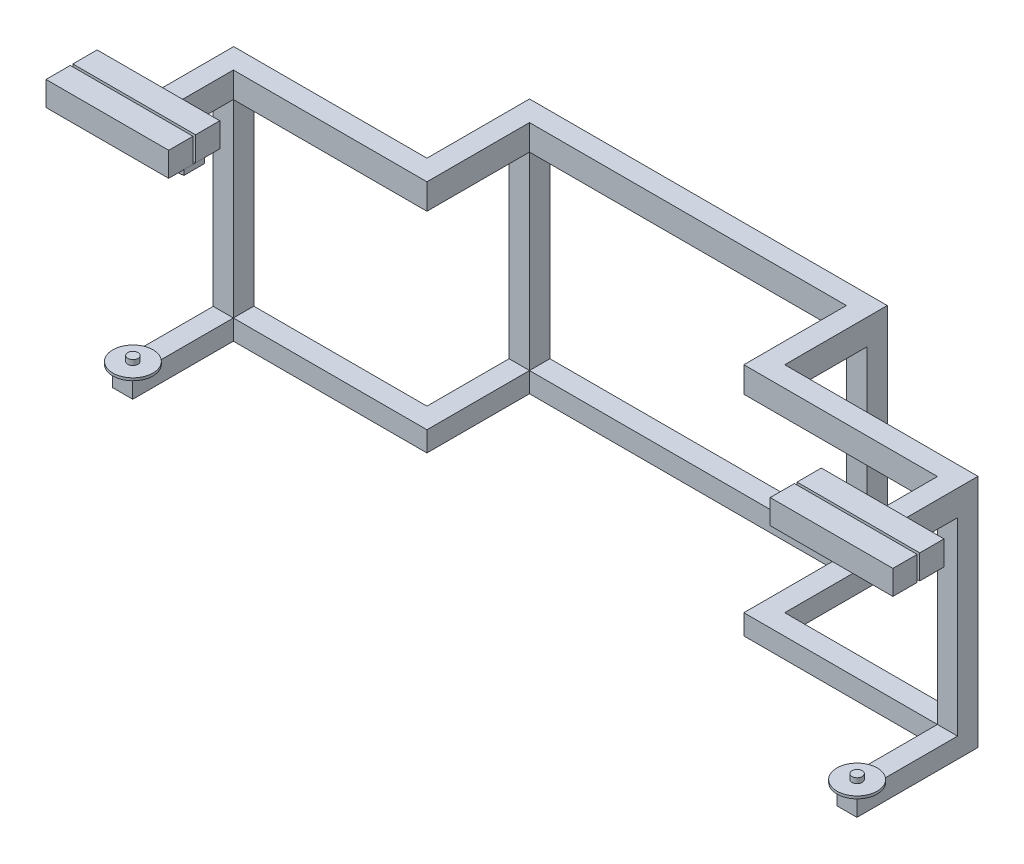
ISO-10303-21;
HEADER;
FILE_DESCRIPTION(('STEP AP214'),'2;1');
FILE_NAME('part.step','',(''),(''),'','','');
FILE_SCHEMA(('AUTOMOTIVE_DESIGN { 1 0 10303 214 1 1 1 1 }'));
ENDSEC;
DATA;
#1=APPLICATION_CONTEXT('core data for automotive mechanical design processes');
#2=APPLICATION_PROTOCOL_DEFINITION('international standard','automotive_design',2000,#1);
#3=PRODUCT_CONTEXT('',#1,'mechanical');
#4=PRODUCT('Part','Part','',(#3));
#5=PRODUCT_RELATED_PRODUCT_CATEGORY('part','',(#4));
#6=PRODUCT_DEFINITION_FORMATION('','',#4);
#7=PRODUCT_DEFINITION_CONTEXT('part definition',#1,'design');
#8=PRODUCT_DEFINITION('design','',#6,#7);
#9=PRODUCT_DEFINITION_SHAPE('','',#8);
#10=(LENGTH_UNIT() NAMED_UNIT(*) SI_UNIT(.MILLI.,.METRE.));
#11=(NAMED_UNIT(*) PLANE_ANGLE_UNIT() SI_UNIT($,.RADIAN.));
#12=(NAMED_UNIT(*) SI_UNIT($,.STERADIAN.) SOLID_ANGLE_UNIT());
#13=UNCERTAINTY_MEASURE_WITH_UNIT(LENGTH_MEASURE(1.E-05),#10,'distance_accuracy_value','');
#14=(GEOMETRIC_REPRESENTATION_CONTEXT(3) GLOBAL_UNCERTAINTY_ASSIGNED_CONTEXT((#13)) GLOBAL_UNIT_ASSIGNED_CONTEXT((#10,
#11,#12)) REPRESENTATION_CONTEXT('',''));
#15=CARTESIAN_POINT('',(0.,0.,0.));
#16=DIRECTION('',(0.,0.,1.));
#17=DIRECTION('',(1.,0.,0.));
#18=AXIS2_PLACEMENT_3D('',#15,#16,#17);
#19=CARTESIAN_POINT('',(1976.55,568.552000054,-88.8999999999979));
#20=DIRECTION('',(0.,0.,1.));
#21=DIRECTION('',(1.,0.,0.));
#22=AXIS2_PLACEMENT_3D('',#19,#20,#21);
#23=PLANE('',#22);
#24=DIRECTION('',(-1.,0.,0.));
#25=VECTOR('',#24,1.);
#26=CARTESIAN_POINT('',(1976.55,508.100000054,-88.8999999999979));
#27=LINE('',#26,#25);
#28=CARTESIAN_POINT('',(1976.55,508.100000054,-88.8999999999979));
#29=VERTEX_POINT('',#28);
#30=CARTESIAN_POINT('',(1671.75,508.100000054,-88.9000000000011));
#31=VERTEX_POINT('',#30);
#32=EDGE_CURVE('E115',#29,#31,#27,.T.);
#33=ORIENTED_EDGE('',*,*,#32,.T.);
#34=DIRECTION('',(0.,-1.,0.));
#35=VECTOR('',#34,1.);
#36=CARTESIAN_POINT('',(1671.75,568.552000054,-88.9000000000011));
#37=LINE('',#36,#35);
#38=CARTESIAN_POINT('',(1671.75,568.552000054,-88.9000000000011));
#39=VERTEX_POINT('',#38);
#40=EDGE_CURVE('E12',#39,#31,#37,.T.);
#41=ORIENTED_EDGE('',*,*,#40,.F.);
#42=DIRECTION('',(-1.,0.,0.));
#43=VECTOR('',#42,1.);
#44=CARTESIAN_POINT('',(1976.55,568.552000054,-88.8999999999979));
#45=LINE('',#44,#43);
#46=CARTESIAN_POINT('',(1976.55,568.552000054,-88.8999999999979));
#47=VERTEX_POINT('',#46);
#48=EDGE_CURVE('E103',#47,#39,#45,.T.);
#49=ORIENTED_EDGE('',*,*,#48,.F.);
#50=DIRECTION('',(0.,-1.,0.));
#51=VECTOR('',#50,1.);
#52=CARTESIAN_POINT('',(1976.55,568.552000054,-88.8999999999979));
#53=LINE('',#52,#51);
#54=EDGE_CURVE('E111',#47,#29,#53,.T.);
#55=ORIENTED_EDGE('',*,*,#54,.T.);
#56=EDGE_LOOP('',(#33,#41,#49,#55));
#57=FACE_BOUND('',#56,.T.);
#58=ADVANCED_FACE('F52',(#57),#23,.F.);
#59=CARTESIAN_POINT('',(1671.75,568.552000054,-88.9000000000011));
#60=DIRECTION('',(1.,0.,0.));
#61=DIRECTION('',(0.,0.,-1.));
#62=AXIS2_PLACEMENT_3D('',#59,#60,#61);
#63=PLANE('',#62);
#64=DIRECTION('',(0.,0.,1.));
#65=VECTOR('',#64,1.);
#66=CARTESIAN_POINT('',(1671.75,508.100000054,-88.9000000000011));
#67=LINE('',#66,#65);
#68=CARTESIAN_POINT('',(1671.75,508.100000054,-28.5750000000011));
#69=VERTEX_POINT('',#68);
#70=EDGE_CURVE('E107',#31,#69,#67,.T.);
#71=ORIENTED_EDGE('',*,*,#70,.T.);
#72=DIRECTION('',(0.,-1.,0.));
#73=VECTOR('',#72,1.);
#74=CARTESIAN_POINT('',(1671.75,568.552000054,-28.5750000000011));
#75=LINE('',#74,#73);
#76=CARTESIAN_POINT('',(1671.75,568.552000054,-28.5750000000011));
#77=VERTEX_POINT('',#76);
#78=EDGE_CURVE('E60',#77,#69,#75,.T.);
#79=ORIENTED_EDGE('',*,*,#78,.F.);
#80=DIRECTION('',(0.,0.,1.));
#81=VECTOR('',#80,1.);
#82=CARTESIAN_POINT('',(1671.75,568.552000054,-88.9000000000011));
#83=LINE('',#82,#81);
#84=EDGE_CURVE('E98',#39,#77,#83,.T.);
#85=ORIENTED_EDGE('',*,*,#84,.F.);
#86=ORIENTED_EDGE('',*,*,#40,.T.);
#87=EDGE_LOOP('',(#71,#79,#85,#86));
#88=FACE_BOUND('',#87,.T.);
#89=ADVANCED_FACE('F106',(#88),#63,.F.);
#90=CARTESIAN_POINT('',(1976.55,568.552000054,-28.5749999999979));
#91=DIRECTION('',(0.,0.,-1.));
#92=DIRECTION('',(-1.,0.,0.));
#93=AXIS2_PLACEMENT_3D('',#90,#91,#92);
#94=PLANE('',#93);
#95=DIRECTION('',(1.,0.,0.));
#96=VECTOR('',#95,1.);
#97=CARTESIAN_POINT('',(1976.55,508.100000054,-28.5749999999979));
#98=LINE('',#97,#96);
#99=CARTESIAN_POINT('',(1976.55,508.100000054,-28.5749999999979));
#100=VERTEX_POINT('',#99);
#101=EDGE_CURVE('E85',#69,#100,#98,.T.);
#102=ORIENTED_EDGE('',*,*,#101,.T.);
#103=DIRECTION('',(0.,-1.,0.));
#104=VECTOR('',#103,1.);
#105=CARTESIAN_POINT('',(1976.55,568.552000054,-28.5749999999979));
#106=LINE('',#105,#104);
#107=CARTESIAN_POINT('',(1976.55,568.552000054,-28.5749999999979));
#108=VERTEX_POINT('',#107);
#109=EDGE_CURVE('E108',#108,#100,#106,.T.);
#110=ORIENTED_EDGE('',*,*,#109,.F.);
#111=DIRECTION('',(1.,0.,0.));
#112=VECTOR('',#111,1.);
#113=CARTESIAN_POINT('',(1976.55,568.552000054,-28.5749999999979));
#114=LINE('',#113,#112);
#115=EDGE_CURVE('E101',#77,#108,#114,.T.);
#116=ORIENTED_EDGE('',*,*,#115,.F.);
#117=ORIENTED_EDGE('',*,*,#78,.T.);
#118=EDGE_LOOP('',(#102,#110,#116,#117));
#119=FACE_BOUND('',#118,.T.);
#120=ADVANCED_FACE('F109',(#119),#94,.F.);
#121=CARTESIAN_POINT('',(1976.55,568.552000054,-88.8999999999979));
#122=DIRECTION('',(-1.,0.,0.));
#123=DIRECTION('',(0.,0.,1.));
#124=AXIS2_PLACEMENT_3D('',#121,#122,#123);
#125=PLANE('',#124);
#126=DIRECTION('',(0.,0.,-1.));
#127=VECTOR('',#126,1.);
#128=CARTESIAN_POINT('',(1976.55,508.100000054,-88.8999999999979));
#129=LINE('',#128,#127);
#130=EDGE_CURVE('E91',#100,#29,#129,.T.);
#131=ORIENTED_EDGE('',*,*,#130,.T.);
#132=ORIENTED_EDGE('',*,*,#54,.F.);
#133=DIRECTION('',(0.,0.,-1.));
#134=VECTOR('',#133,1.);
#135=CARTESIAN_POINT('',(1976.55,568.552000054,-88.8999999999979));
#136=LINE('',#135,#134);
#137=EDGE_CURVE('E68',#108,#47,#136,.T.);
#138=ORIENTED_EDGE('',*,*,#137,.F.);
#139=ORIENTED_EDGE('',*,*,#109,.T.);
#140=EDGE_LOOP('',(#131,#132,#138,#139));
#141=FACE_BOUND('',#140,.T.);
#142=ADVANCED_FACE('F122',(#141),#125,.F.);
#143=CARTESIAN_POINT('',(0.,568.552000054,0.));
#144=DIRECTION('',(0.,1.,0.));
#145=DIRECTION('',(0.,0.,1.));
#146=AXIS2_PLACEMENT_3D('',#143,#144,#145);
#147=PLANE('',#146);
#148=ORIENTED_EDGE('',*,*,#48,.T.);
#149=ORIENTED_EDGE('',*,*,#84,.T.);
#150=ORIENTED_EDGE('',*,*,#115,.T.);
#151=ORIENTED_EDGE('',*,*,#137,.T.);
#152=EDGE_LOOP('',(#148,#149,#150,#151));
#153=FACE_BOUND('',#152,.T.);
#154=ADVANCED_FACE('F99',(#153),#147,.T.);
#155=CARTESIAN_POINT('',(0.,508.100000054,0.));
#156=DIRECTION('',(0.,1.,0.));
#157=DIRECTION('',(0.,0.,1.));
#158=AXIS2_PLACEMENT_3D('',#155,#156,#157);
#159=PLANE('',#158);
#160=ORIENTED_EDGE('',*,*,#32,.F.);
#161=ORIENTED_EDGE('',*,*,#130,.F.);
#162=ORIENTED_EDGE('',*,*,#101,.F.);
#163=ORIENTED_EDGE('',*,*,#70,.F.);
#164=EDGE_LOOP('',(#160,#161,#162,#163));
#165=FACE_BOUND('',#164,.T.);
#166=ADVANCED_FACE('F125',(#165),#159,.F.);
#167=CLOSED_SHELL('',(#58,#89,#120,#142,#154,#166));
#168=MANIFOLD_SOLID_BREP('B2',#167);
#169=CARTESIAN_POINT('',(1976.55,568.552000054,38.1000000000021));
#170=DIRECTION('',(0.,0.,-1.));
#171=DIRECTION('',(-1.,0.,0.));
#172=AXIS2_PLACEMENT_3D('',#169,#170,#171);
#173=PLANE('',#172);
#174=DIRECTION('',(1.,0.,0.));
#175=VECTOR('',#174,1.);
#176=CARTESIAN_POINT('',(1976.55,508.100000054,38.1000000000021));
#177=LINE('',#176,#175);
#178=CARTESIAN_POINT('',(1671.75,508.100000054,38.0999999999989));
#179=VERTEX_POINT('',#178);
#180=CARTESIAN_POINT('',(1976.55,508.100000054,38.1000000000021));
#181=VERTEX_POINT('',#180);
#182=EDGE_CURVE('E249',#179,#181,#177,.T.);
#183=ORIENTED_EDGE('',*,*,#182,.T.);
#184=DIRECTION('',(0.,-1.,0.));
#185=VECTOR('',#184,1.);
#186=CARTESIAN_POINT('',(1976.55,568.552000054,38.1000000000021));
#187=LINE('',#186,#185);
#188=CARTESIAN_POINT('',(1976.55,568.552000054,38.1000000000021));
#189=VERTEX_POINT('',#188);
#190=EDGE_CURVE('E50',#189,#181,#187,.T.);
#191=ORIENTED_EDGE('',*,*,#190,.F.);
#192=DIRECTION('',(1.,0.,0.));
#193=VECTOR('',#192,1.);
#194=CARTESIAN_POINT('',(1976.55,568.552000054,38.1000000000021));
#195=LINE('',#194,#193);
#196=CARTESIAN_POINT('',(1671.75,568.552000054,38.0999999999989));
#197=VERTEX_POINT('',#196);
#198=EDGE_CURVE('E237',#197,#189,#195,.T.);
#199=ORIENTED_EDGE('',*,*,#198,.F.);
#200=DIRECTION('',(0.,-1.,0.));
#201=VECTOR('',#200,1.);
#202=CARTESIAN_POINT('',(1671.75,568.552000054,38.0999999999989));
#203=LINE('',#202,#201);
#204=EDGE_CURVE('E245',#197,#179,#203,.T.);
#205=ORIENTED_EDGE('',*,*,#204,.T.);
#206=EDGE_LOOP('',(#183,#191,#199,#205));
#207=FACE_BOUND('',#206,.T.);
#208=ADVANCED_FACE('F186',(#207),#173,.F.);
#209=CARTESIAN_POINT('',(1976.55,568.552000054,-22.2249999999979));
#210=DIRECTION('',(-1.,0.,0.));
#211=DIRECTION('',(0.,0.,1.));
#212=AXIS2_PLACEMENT_3D('',#209,#210,#211);
#213=PLANE('',#212);
#214=DIRECTION('',(0.,0.,-1.));
#215=VECTOR('',#214,1.);
#216=CARTESIAN_POINT('',(1976.55,508.100000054,-22.2249999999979));
#217=LINE('',#216,#215);
#218=CARTESIAN_POINT('',(1976.55,508.100000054,-22.2249999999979));
#219=VERTEX_POINT('',#218);
#220=EDGE_CURVE('E241',#181,#219,#217,.T.);
#221=ORIENTED_EDGE('',*,*,#220,.T.);
#222=DIRECTION('',(0.,-1.,0.));
#223=VECTOR('',#222,1.);
#224=CARTESIAN_POINT('',(1976.55,568.552000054,-22.2249999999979));
#225=LINE('',#224,#223);
#226=CARTESIAN_POINT('',(1976.55,568.552000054,-22.2249999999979));
#227=VERTEX_POINT('',#226);
#228=EDGE_CURVE('E194',#227,#219,#225,.T.);
#229=ORIENTED_EDGE('',*,*,#228,.F.);
#230=DIRECTION('',(0.,0.,-1.));
#231=VECTOR('',#230,1.);
#232=CARTESIAN_POINT('',(1976.55,568.552000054,-22.2249999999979));
#233=LINE('',#232,#231);
#234=EDGE_CURVE('E232',#189,#227,#233,.T.);
#235=ORIENTED_EDGE('',*,*,#234,.F.);
#236=ORIENTED_EDGE('',*,*,#190,.T.);
#237=EDGE_LOOP('',(#221,#229,#235,#236));
#238=FACE_BOUND('',#237,.T.);
#239=ADVANCED_FACE('F240',(#238),#213,.F.);
#240=CARTESIAN_POINT('',(1976.55,568.552000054,-22.2249999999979));
#241=DIRECTION('',(0.,0.,1.));
#242=DIRECTION('',(1.,0.,0.));
#243=AXIS2_PLACEMENT_3D('',#240,#241,#242);
#244=PLANE('',#243);
#245=DIRECTION('',(-1.,0.,0.));
#246=VECTOR('',#245,1.);
#247=CARTESIAN_POINT('',(1976.55,508.100000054,-22.2249999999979));
#248=LINE('',#247,#246);
#249=CARTESIAN_POINT('',(1671.75,508.100000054,-22.2250000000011));
#250=VERTEX_POINT('',#249);
#251=EDGE_CURVE('E219',#219,#250,#248,.T.);
#252=ORIENTED_EDGE('',*,*,#251,.T.);
#253=DIRECTION('',(0.,-1.,0.));
#254=VECTOR('',#253,1.);
#255=CARTESIAN_POINT('',(1671.75,568.552000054,-22.2250000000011));
#256=LINE('',#255,#254);
#257=CARTESIAN_POINT('',(1671.75,568.552000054,-22.2250000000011));
#258=VERTEX_POINT('',#257);
#259=EDGE_CURVE('E242',#258,#250,#256,.T.);
#260=ORIENTED_EDGE('',*,*,#259,.F.);
#261=DIRECTION('',(-1.,0.,0.));
#262=VECTOR('',#261,1.);
#263=CARTESIAN_POINT('',(1976.55,568.552000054,-22.2249999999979));
#264=LINE('',#263,#262);
#265=EDGE_CURVE('E235',#227,#258,#264,.T.);
#266=ORIENTED_EDGE('',*,*,#265,.F.);
#267=ORIENTED_EDGE('',*,*,#228,.T.);
#268=EDGE_LOOP('',(#252,#260,#266,#267));
#269=FACE_BOUND('',#268,.T.);
#270=ADVANCED_FACE('F243',(#269),#244,.F.);
#271=CARTESIAN_POINT('',(1671.75,568.552000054,-22.2250000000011));
#272=DIRECTION('',(1.,0.,0.));
#273=DIRECTION('',(0.,0.,-1.));
#274=AXIS2_PLACEMENT_3D('',#271,#272,#273);
#275=PLANE('',#274);
#276=DIRECTION('',(0.,0.,1.));
#277=VECTOR('',#276,1.);
#278=CARTESIAN_POINT('',(1671.75,508.100000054,-22.2250000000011));
#279=LINE('',#278,#277);
#280=EDGE_CURVE('E225',#250,#179,#279,.T.);
#281=ORIENTED_EDGE('',*,*,#280,.T.);
#282=ORIENTED_EDGE('',*,*,#204,.F.);
#283=DIRECTION('',(0.,0.,1.));
#284=VECTOR('',#283,1.);
#285=CARTESIAN_POINT('',(1671.75,568.552000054,-22.2250000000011));
#286=LINE('',#285,#284);
#287=EDGE_CURVE('E202',#258,#197,#286,.T.);
#288=ORIENTED_EDGE('',*,*,#287,.F.);
#289=ORIENTED_EDGE('',*,*,#259,.T.);
#290=EDGE_LOOP('',(#281,#282,#288,#289));
#291=FACE_BOUND('',#290,.T.);
#292=ADVANCED_FACE('F256',(#291),#275,.F.);
#293=CARTESIAN_POINT('',(0.,568.552000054,0.));
#294=DIRECTION('',(0.,1.,0.));
#295=DIRECTION('',(0.,0.,1.));
#296=AXIS2_PLACEMENT_3D('',#293,#294,#295);
#297=PLANE('',#296);
#298=ORIENTED_EDGE('',*,*,#198,.T.);
#299=ORIENTED_EDGE('',*,*,#234,.T.);
#300=ORIENTED_EDGE('',*,*,#265,.T.);
#301=ORIENTED_EDGE('',*,*,#287,.T.);
#302=EDGE_LOOP('',(#298,#299,#300,#301));
#303=FACE_BOUND('',#302,.T.);
#304=ADVANCED_FACE('F233',(#303),#297,.T.);
#305=CARTESIAN_POINT('',(0.,508.100000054,0.));
#306=DIRECTION('',(0.,1.,0.));
#307=DIRECTION('',(0.,0.,1.));
#308=AXIS2_PLACEMENT_3D('',#305,#306,#307);
#309=PLANE('',#308);
#310=ORIENTED_EDGE('',*,*,#182,.F.);
#311=ORIENTED_EDGE('',*,*,#280,.F.);
#312=ORIENTED_EDGE('',*,*,#251,.F.);
#313=ORIENTED_EDGE('',*,*,#220,.F.);
#314=EDGE_LOOP('',(#310,#311,#312,#313));
#315=FACE_BOUND('',#314,.T.);
#316=ADVANCED_FACE('F259',(#315),#309,.F.);
#317=CLOSED_SHELL('',(#208,#239,#270,#292,#304,#316));
#318=MANIFOLD_SOLID_BREP('B6',#317);
#319=CARTESIAN_POINT('',(177.399999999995,568.552000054,-22.225000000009));
#320=DIRECTION('',(-1.,0.,0.));
#321=DIRECTION('',(0.,0.,1.));
#322=AXIS2_PLACEMENT_3D('',#319,#320,#321);
#323=PLANE('',#322);
#324=DIRECTION('',(0.,0.,-1.));
#325=VECTOR('',#324,1.);
#326=CARTESIAN_POINT('',(177.399999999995,508.100000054,-22.225000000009));
#327=LINE('',#326,#325);
#328=CARTESIAN_POINT('',(177.399999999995,508.100000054,38.099999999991));
#329=VERTEX_POINT('',#328);
#330=CARTESIAN_POINT('',(177.399999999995,508.100000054,-22.225000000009));
#331=VERTEX_POINT('',#330);
#332=EDGE_CURVE('E383',#329,#331,#327,.T.);
#333=ORIENTED_EDGE('',*,*,#332,.T.);
#334=DIRECTION('',(0.,-1.,0.));
#335=VECTOR('',#334,1.);
#336=CARTESIAN_POINT('',(177.399999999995,568.552000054,-22.225000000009));
#337=LINE('',#336,#335);
#338=CARTESIAN_POINT('',(177.399999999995,568.552000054,-22.225000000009));
#339=VERTEX_POINT('',#338);
#340=EDGE_CURVE('E184',#339,#331,#337,.T.);
#341=ORIENTED_EDGE('',*,*,#340,.F.);
#342=DIRECTION('',(0.,0.,-1.));
#343=VECTOR('',#342,1.);
#344=CARTESIAN_POINT('',(177.399999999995,568.552000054,-22.225000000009));
#345=LINE('',#344,#343);
#346=CARTESIAN_POINT('',(177.399999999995,568.552000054,38.099999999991));
#347=VERTEX_POINT('',#346);
#348=EDGE_CURVE('E371',#347,#339,#345,.T.);
#349=ORIENTED_EDGE('',*,*,#348,.F.);
#350=DIRECTION('',(0.,-1.,0.));
#351=VECTOR('',#350,1.);
#352=CARTESIAN_POINT('',(177.399999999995,568.552000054,38.099999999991));
#353=LINE('',#352,#351);
#354=EDGE_CURVE('E379',#347,#329,#353,.T.);
#355=ORIENTED_EDGE('',*,*,#354,.T.);
#356=EDGE_LOOP('',(#333,#341,#349,#355));
#357=FACE_BOUND('',#356,.T.);
#358=ADVANCED_FACE('F320',(#357),#323,.F.);
#359=CARTESIAN_POINT('',(-127.400000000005,568.552000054,-22.225000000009));
#360=DIRECTION('',(0.,0.,1.));
#361=DIRECTION('',(1.,0.,0.));
#362=AXIS2_PLACEMENT_3D('',#359,#360,#361);
#363=PLANE('',#362);
#364=DIRECTION('',(-1.,0.,0.));
#365=VECTOR('',#364,1.);
#366=CARTESIAN_POINT('',(-127.400000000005,508.100000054,-22.225000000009));
#367=LINE('',#366,#365);
#368=CARTESIAN_POINT('',(-127.400000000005,508.100000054,-22.225000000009));
#369=VERTEX_POINT('',#368);
#370=EDGE_CURVE('E375',#331,#369,#367,.T.);
#371=ORIENTED_EDGE('',*,*,#370,.T.);
#372=DIRECTION('',(0.,-1.,0.));
#373=VECTOR('',#372,1.);
#374=CARTESIAN_POINT('',(-127.400000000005,568.552000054,-22.225000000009));
#375=LINE('',#374,#373);
#376=CARTESIAN_POINT('',(-127.400000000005,568.552000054,-22.225000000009));
#377=VERTEX_POINT('',#376);
#378=EDGE_CURVE('E328',#377,#369,#375,.T.);
#379=ORIENTED_EDGE('',*,*,#378,.F.);
#380=DIRECTION('',(-1.,0.,0.));
#381=VECTOR('',#380,1.);
#382=CARTESIAN_POINT('',(-127.400000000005,568.552000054,-22.225000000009));
#383=LINE('',#382,#381);
#384=EDGE_CURVE('E366',#339,#377,#383,.T.);
#385=ORIENTED_EDGE('',*,*,#384,.F.);
#386=ORIENTED_EDGE('',*,*,#340,.T.);
#387=EDGE_LOOP('',(#371,#379,#385,#386));
#388=FACE_BOUND('',#387,.T.);
#389=ADVANCED_FACE('F374',(#388),#363,.F.);
#390=CARTESIAN_POINT('',(-127.400000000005,568.552000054,-22.225000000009));
#391=DIRECTION('',(1.,0.,0.));
#392=DIRECTION('',(0.,0.,-1.));
#393=AXIS2_PLACEMENT_3D('',#390,#391,#392);
#394=PLANE('',#393);
#395=DIRECTION('',(0.,0.,1.));
#396=VECTOR('',#395,1.);
#397=CARTESIAN_POINT('',(-127.400000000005,508.100000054,-22.225000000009));
#398=LINE('',#397,#396);
#399=CARTESIAN_POINT('',(-127.400000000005,508.100000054,38.099999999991));
#400=VERTEX_POINT('',#399);
#401=EDGE_CURVE('E353',#369,#400,#398,.T.);
#402=ORIENTED_EDGE('',*,*,#401,.T.);
#403=DIRECTION('',(0.,-1.,0.));
#404=VECTOR('',#403,1.);
#405=CARTESIAN_POINT('',(-127.400000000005,568.552000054,38.099999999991));
#406=LINE('',#405,#404);
#407=CARTESIAN_POINT('',(-127.400000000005,568.552000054,38.099999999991));
#408=VERTEX_POINT('',#407);
#409=EDGE_CURVE('E376',#408,#400,#406,.T.);
#410=ORIENTED_EDGE('',*,*,#409,.F.);
#411=DIRECTION('',(0.,0.,1.));
#412=VECTOR('',#411,1.);
#413=CARTESIAN_POINT('',(-127.400000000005,568.552000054,-22.225000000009));
#414=LINE('',#413,#412);
#415=EDGE_CURVE('E369',#377,#408,#414,.T.);
#416=ORIENTED_EDGE('',*,*,#415,.F.);
#417=ORIENTED_EDGE('',*,*,#378,.T.);
#418=EDGE_LOOP('',(#402,#410,#416,#417));
#419=FACE_BOUND('',#418,.T.);
#420=ADVANCED_FACE('F377',(#419),#394,.F.);
#421=CARTESIAN_POINT('',(-127.400000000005,568.552000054,38.099999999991));
#422=DIRECTION('',(0.,0.,-1.));
#423=DIRECTION('',(-1.,0.,0.));
#424=AXIS2_PLACEMENT_3D('',#421,#422,#423);
#425=PLANE('',#424);
#426=DIRECTION('',(1.,0.,0.));
#427=VECTOR('',#426,1.);
#428=CARTESIAN_POINT('',(-127.400000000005,508.100000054,38.099999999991));
#429=LINE('',#428,#427);
#430=EDGE_CURVE('E359',#400,#329,#429,.T.);
#431=ORIENTED_EDGE('',*,*,#430,.T.);
#432=ORIENTED_EDGE('',*,*,#354,.F.);
#433=DIRECTION('',(1.,0.,0.));
#434=VECTOR('',#433,1.);
#435=CARTESIAN_POINT('',(-127.400000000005,568.552000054,38.099999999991));
#436=LINE('',#435,#434);
#437=EDGE_CURVE('E336',#408,#347,#436,.T.);
#438=ORIENTED_EDGE('',*,*,#437,.F.);
#439=ORIENTED_EDGE('',*,*,#409,.T.);
#440=EDGE_LOOP('',(#431,#432,#438,#439));
#441=FACE_BOUND('',#440,.T.);
#442=ADVANCED_FACE('F390',(#441),#425,.F.);
#443=CARTESIAN_POINT('',(0.,568.552000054,0.));
#444=DIRECTION('',(0.,1.,0.));
#445=DIRECTION('',(0.,0.,1.));
#446=AXIS2_PLACEMENT_3D('',#443,#444,#445);
#447=PLANE('',#446);
#448=ORIENTED_EDGE('',*,*,#348,.T.);
#449=ORIENTED_EDGE('',*,*,#384,.T.);
#450=ORIENTED_EDGE('',*,*,#415,.T.);
#451=ORIENTED_EDGE('',*,*,#437,.T.);
#452=EDGE_LOOP('',(#448,#449,#450,#451));
#453=FACE_BOUND('',#452,.T.);
#454=ADVANCED_FACE('F367',(#453),#447,.T.);
#455=CARTESIAN_POINT('',(0.,508.100000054,0.));
#456=DIRECTION('',(0.,1.,0.));
#457=DIRECTION('',(0.,0.,1.));
#458=AXIS2_PLACEMENT_3D('',#455,#456,#457);
#459=PLANE('',#458);
#460=ORIENTED_EDGE('',*,*,#332,.F.);
#461=ORIENTED_EDGE('',*,*,#430,.F.);
#462=ORIENTED_EDGE('',*,*,#401,.F.);
#463=ORIENTED_EDGE('',*,*,#370,.F.);
#464=EDGE_LOOP('',(#460,#461,#462,#463));
#465=FACE_BOUND('',#464,.T.);
#466=ADVANCED_FACE('F393',(#465),#459,.F.);
#467=CLOSED_SHELL('',(#358,#389,#420,#442,#454,#466));
#468=MANIFOLD_SOLID_BREP('B44',#467);
#469=CARTESIAN_POINT('',(-127.400000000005,568.552000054,-88.900000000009));
#470=DIRECTION('',(1.,0.,0.));
#471=DIRECTION('',(0.,0.,-1.));
#472=AXIS2_PLACEMENT_3D('',#469,#470,#471);
#473=PLANE('',#472);
#474=DIRECTION('',(0.,0.,1.));
#475=VECTOR('',#474,1.);
#476=CARTESIAN_POINT('',(-127.400000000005,508.100000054,-88.900000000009));
#477=LINE('',#476,#475);
#478=CARTESIAN_POINT('',(-127.400000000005,508.100000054,-88.900000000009));
#479=VERTEX_POINT('',#478);
#480=CARTESIAN_POINT('',(-127.400000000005,508.100000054,-28.575000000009));
#481=VERTEX_POINT('',#480);
#482=EDGE_CURVE('E516',#479,#481,#477,.T.);
#483=ORIENTED_EDGE('',*,*,#482,.T.);
#484=DIRECTION('',(0.,-1.,0.));
#485=VECTOR('',#484,1.);
#486=CARTESIAN_POINT('',(-127.400000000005,568.552000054,-28.575000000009));
#487=LINE('',#486,#485);
#488=CARTESIAN_POINT('',(-127.400000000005,568.552000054,-28.575000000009));
#489=VERTEX_POINT('',#488);
#490=EDGE_CURVE('E318',#489,#481,#487,.T.);
#491=ORIENTED_EDGE('',*,*,#490,.F.);
#492=DIRECTION('',(0.,0.,1.));
#493=VECTOR('',#492,1.);
#494=CARTESIAN_POINT('',(-127.400000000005,568.552000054,-88.900000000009));
#495=LINE('',#494,#493);
#496=CARTESIAN_POINT('',(-127.400000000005,568.552000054,-88.900000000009));
#497=VERTEX_POINT('',#496);
#498=EDGE_CURVE('E504',#497,#489,#495,.T.);
#499=ORIENTED_EDGE('',*,*,#498,.F.);
#500=DIRECTION('',(0.,-1.,0.));
#501=VECTOR('',#500,1.);
#502=CARTESIAN_POINT('',(-127.400000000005,568.552000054,-88.900000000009));
#503=LINE('',#502,#501);
#504=EDGE_CURVE('E512',#497,#479,#503,.T.);
#505=ORIENTED_EDGE('',*,*,#504,.T.);
#506=EDGE_LOOP('',(#483,#491,#499,#505));
#507=FACE_BOUND('',#506,.T.);
#508=ADVANCED_FACE('F453',(#507),#473,.F.);
#509=CARTESIAN_POINT('',(-127.400000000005,568.552000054,-28.575000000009));
#510=DIRECTION('',(0.,0.,-1.));
#511=DIRECTION('',(-1.,0.,0.));
#512=AXIS2_PLACEMENT_3D('',#509,#510,#511);
#513=PLANE('',#512);
#514=DIRECTION('',(1.,0.,0.));
#515=VECTOR('',#514,1.);
#516=CARTESIAN_POINT('',(-127.400000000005,508.100000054,-28.575000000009));
#517=LINE('',#516,#515);
#518=CARTESIAN_POINT('',(177.399999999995,508.100000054,-28.575000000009));
#519=VERTEX_POINT('',#518);
#520=EDGE_CURVE('E508',#481,#519,#517,.T.);
#521=ORIENTED_EDGE('',*,*,#520,.T.);
#522=DIRECTION('',(0.,-1.,0.));
#523=VECTOR('',#522,1.);
#524=CARTESIAN_POINT('',(177.399999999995,568.552000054,-28.575000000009));
#525=LINE('',#524,#523);
#526=CARTESIAN_POINT('',(177.399999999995,568.552000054,-28.575000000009));
#527=VERTEX_POINT('',#526);
#528=EDGE_CURVE('E461',#527,#519,#525,.T.);
#529=ORIENTED_EDGE('',*,*,#528,.F.);
#530=DIRECTION('',(1.,0.,0.));
#531=VECTOR('',#530,1.);
#532=CARTESIAN_POINT('',(-127.400000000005,568.552000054,-28.575000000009));
#533=LINE('',#532,#531);
#534=EDGE_CURVE('E499',#489,#527,#533,.T.);
#535=ORIENTED_EDGE('',*,*,#534,.F.);
#536=ORIENTED_EDGE('',*,*,#490,.T.);
#537=EDGE_LOOP('',(#521,#529,#535,#536));
#538=FACE_BOUND('',#537,.T.);
#539=ADVANCED_FACE('F507',(#538),#513,.F.);
#540=CARTESIAN_POINT('',(177.399999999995,568.552000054,-88.900000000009));
#541=DIRECTION('',(-1.,0.,0.));
#542=DIRECTION('',(0.,0.,1.));
#543=AXIS2_PLACEMENT_3D('',#540,#541,#542);
#544=PLANE('',#543);
#545=DIRECTION('',(0.,0.,-1.));
#546=VECTOR('',#545,1.);
#547=CARTESIAN_POINT('',(177.399999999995,508.100000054,-88.900000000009));
#548=LINE('',#547,#546);
#549=CARTESIAN_POINT('',(177.399999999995,508.100000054,-88.900000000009));
#550=VERTEX_POINT('',#549);
#551=EDGE_CURVE('E486',#519,#550,#548,.T.);
#552=ORIENTED_EDGE('',*,*,#551,.T.);
#553=DIRECTION('',(0.,-1.,0.));
#554=VECTOR('',#553,1.);
#555=CARTESIAN_POINT('',(177.399999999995,568.552000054,-88.900000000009));
#556=LINE('',#555,#554);
#557=CARTESIAN_POINT('',(177.399999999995,568.552000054,-88.900000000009));
#558=VERTEX_POINT('',#557);
#559=EDGE_CURVE('E509',#558,#550,#556,.T.);
#560=ORIENTED_EDGE('',*,*,#559,.F.);
#561=DIRECTION('',(0.,0.,-1.));
#562=VECTOR('',#561,1.);
#563=CARTESIAN_POINT('',(177.399999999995,568.552000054,-88.900000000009));
#564=LINE('',#563,#562);
#565=EDGE_CURVE('E502',#527,#558,#564,.T.);
#566=ORIENTED_EDGE('',*,*,#565,.F.);
#567=ORIENTED_EDGE('',*,*,#528,.T.);
#568=EDGE_LOOP('',(#552,#560,#566,#567));
#569=FACE_BOUND('',#568,.T.);
#570=ADVANCED_FACE('F510',(#569),#544,.F.);
#571=CARTESIAN_POINT('',(-127.400000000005,568.552000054,-88.900000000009));
#572=DIRECTION('',(0.,0.,1.));
#573=DIRECTION('',(1.,0.,0.));
#574=AXIS2_PLACEMENT_3D('',#571,#572,#573);
#575=PLANE('',#574);
#576=DIRECTION('',(-1.,0.,0.));
#577=VECTOR('',#576,1.);
#578=CARTESIAN_POINT('',(-127.400000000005,508.100000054,-88.900000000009));
#579=LINE('',#578,#577);
#580=EDGE_CURVE('E492',#550,#479,#579,.T.);
#581=ORIENTED_EDGE('',*,*,#580,.T.);
#582=ORIENTED_EDGE('',*,*,#504,.F.);
#583=DIRECTION('',(-1.,0.,0.));
#584=VECTOR('',#583,1.);
#585=CARTESIAN_POINT('',(-127.400000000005,568.552000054,-88.900000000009));
#586=LINE('',#585,#584);
#587=EDGE_CURVE('E469',#558,#497,#586,.T.);
#588=ORIENTED_EDGE('',*,*,#587,.F.);
#589=ORIENTED_EDGE('',*,*,#559,.T.);
#590=EDGE_LOOP('',(#581,#582,#588,#589));
#591=FACE_BOUND('',#590,.T.);
#592=ADVANCED_FACE('F523',(#591),#575,.F.);
#593=CARTESIAN_POINT('',(0.,568.552000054,0.));
#594=DIRECTION('',(0.,1.,0.));
#595=DIRECTION('',(0.,0.,1.));
#596=AXIS2_PLACEMENT_3D('',#593,#594,#595);
#597=PLANE('',#596);
#598=ORIENTED_EDGE('',*,*,#498,.T.);
#599=ORIENTED_EDGE('',*,*,#534,.T.);
#600=ORIENTED_EDGE('',*,*,#565,.T.);
#601=ORIENTED_EDGE('',*,*,#587,.T.);
#602=EDGE_LOOP('',(#598,#599,#600,#601));
#603=FACE_BOUND('',#602,.T.);
#604=ADVANCED_FACE('F500',(#603),#597,.T.);
#605=CARTESIAN_POINT('',(0.,508.100000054,0.));
#606=DIRECTION('',(0.,1.,0.));
#607=DIRECTION('',(0.,0.,1.));
#608=AXIS2_PLACEMENT_3D('',#605,#606,#607);
#609=PLANE('',#608);
#610=ORIENTED_EDGE('',*,*,#482,.F.);
#611=ORIENTED_EDGE('',*,*,#580,.F.);
#612=ORIENTED_EDGE('',*,*,#551,.F.);
#613=ORIENTED_EDGE('',*,*,#520,.F.);
#614=EDGE_LOOP('',(#610,#611,#612,#613));
#615=FACE_BOUND('',#614,.T.);
#616=ADVANCED_FACE('F526',(#615),#609,.F.);
#617=CLOSED_SHELL('',(#508,#539,#570,#592,#604,#616));
#618=MANIFOLD_SOLID_BREP('B178',#617);
#619=CARTESIAN_POINT('',(1849.15,731.928753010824,-88.9));
#620=DIRECTION('',(0.,0.,1.));
#621=DIRECTION('',(1.,0.,0.));
#622=AXIS2_PLACEMENT_3D('',#619,#620,#621);
#623=PLANE('',#622);
#624=DIRECTION('',(0.,-1.,0.));
#625=VECTOR('',#624,1.);
#626=CARTESIAN_POINT('',(1799.15,731.928753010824,-88.9));
#627=LINE('',#626,#625);
#628=CARTESIAN_POINT('',(1799.15,533.500000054,-88.9));
#629=VERTEX_POINT('',#628);
#630=CARTESIAN_POINT('',(1799.15,508.100000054,-88.900000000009));
#631=VERTEX_POINT('',#630);
#632=EDGE_CURVE('E1358',#629,#631,#627,.T.);
#633=ORIENTED_EDGE('',*,*,#632,.T.);
#634=DIRECTION('',(-1.,0.,0.));
#635=VECTOR('',#634,1.);
#636=CARTESIAN_POINT('',(1849.15,508.100000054,-88.9000000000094));
#637=LINE('',#636,#635);
#638=CARTESIAN_POINT('',(1849.15,508.100000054,-88.9));
#639=VERTEX_POINT('',#638);
#640=EDGE_CURVE('E947',#639,#631,#637,.T.);
#641=ORIENTED_EDGE('',*,*,#640,.F.);
#642=DIRECTION('',(0.,-1.,0.));
#643=VECTOR('',#642,1.);
#644=CARTESIAN_POINT('',(1849.15,731.928753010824,-88.9));
#645=LINE('',#644,#643);
#646=CARTESIAN_POINT('',(1849.15,533.500000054,-88.9));
#647=VERTEX_POINT('',#646);
#648=EDGE_CURVE('E1283',#647,#639,#645,.T.);
#649=ORIENTED_EDGE('',*,*,#648,.F.);
#650=DIRECTION('',(-1.,0.,0.));
#651=VECTOR('',#650,1.);
#652=CARTESIAN_POINT('',(1849.15,533.500000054,-88.9));
#653=LINE('',#652,#651);
#654=EDGE_CURVE('E1325',#647,#629,#653,.T.);
#655=ORIENTED_EDGE('',*,*,#654,.T.);
#656=EDGE_LOOP('',(#633,#641,#649,#655));
#657=FACE_BOUND('',#656,.T.);
#658=ADVANCED_FACE('F577',(#657),#623,.T.);
#659=CARTESIAN_POINT('',(-4.66293670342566E-12,731.928753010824,-88.9000000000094));
#660=DIRECTION('',(0.,0.,1.));
#661=DIRECTION('',(1.,0.,0.));
#662=AXIS2_PLACEMENT_3D('',#659,#660,#661);
#663=PLANE('',#662);
#664=DIRECTION('',(0.,-1.,0.));
#665=VECTOR('',#664,1.);
#666=CARTESIAN_POINT('',(49.9999999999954,731.928753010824,-88.900000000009));
#667=LINE('',#666,#665);
#668=CARTESIAN_POINT('',(49.9999999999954,495.400000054,-88.900000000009));
#669=VERTEX_POINT('',#668);
#670=CARTESIAN_POINT('',(50.,470.000000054,-88.9000000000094));
#671=VERTEX_POINT('',#670);
#672=EDGE_CURVE('E602',#669,#671,#667,.T.);
#673=ORIENTED_EDGE('',*,*,#672,.F.);
#674=DIRECTION('',(-1.,0.,0.));
#675=VECTOR('',#674,1.);
#676=CARTESIAN_POINT('',(-4.66293670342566E-12,495.400000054,-88.9000000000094));
#677=LINE('',#676,#675);
#678=CARTESIAN_POINT('',(-4.66293670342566E-12,495.400000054,-88.9000000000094));
#679=VERTEX_POINT('',#678);
#680=EDGE_CURVE('E970',#669,#679,#677,.T.);
#681=ORIENTED_EDGE('',*,*,#680,.T.);
#682=DIRECTION('',(0.,-1.,0.));
#683=VECTOR('',#682,1.);
#684=CARTESIAN_POINT('',(-4.66293670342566E-12,731.928753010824,-88.9000000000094));
#685=LINE('',#684,#683);
#686=CARTESIAN_POINT('',(-4.66293670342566E-12,470.000000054,-88.9000000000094));
#687=VERTEX_POINT('',#686);
#688=EDGE_CURVE('E1355',#679,#687,#685,.T.);
#689=ORIENTED_EDGE('',*,*,#688,.T.);
#690=DIRECTION('',(-1.,0.,0.));
#691=VECTOR('',#690,1.);
#692=CARTESIAN_POINT('',(-4.66293670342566E-12,470.000000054,-88.9000000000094));
#693=LINE('',#692,#691);
#694=EDGE_CURVE('E1208',#671,#687,#693,.T.);
#695=ORIENTED_EDGE('',*,*,#694,.F.);
#696=EDGE_LOOP('',(#673,#681,#689,#695));
#697=FACE_BOUND('',#696,.T.);
#698=ADVANCED_FACE('F1448',(#697),#663,.T.);
#699=CARTESIAN_POINT('',(0.,0.,-300.74578));
#700=DIRECTION('',(-1.,0.,0.));
#701=DIRECTION('',(0.,-1.,0.));
#702=AXIS2_PLACEMENT_3D('',#699,#700,#701);
#703=PLANE('',#702);
#704=DIRECTION('',(0.,0.,1.));
#705=VECTOR('',#704,1.);
#706=CARTESIAN_POINT('',(0.,470.000000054,-300.74578));
#707=LINE('',#706,#705);
#708=CARTESIAN_POINT('',(0.,470.000000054,-249.94578));
#709=VERTEX_POINT('',#708);
#710=EDGE_CURVE('E1013',#709,#687,#707,.T.);
#711=ORIENTED_EDGE('',*,*,#710,.T.);
#712=ORIENTED_EDGE('',*,*,#688,.F.);
#713=DIRECTION('',(0.,1.,0.));
#714=VECTOR('',#713,1.);
#715=CARTESIAN_POINT('',(-4.66293670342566E-12,495.400000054,-88.9000000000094));
#716=LINE('',#715,#714);
#717=CARTESIAN_POINT('',(-4.66293670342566E-12,508.100000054,-88.9000000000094));
#718=VERTEX_POINT('',#717);
#719=EDGE_CURVE('E990',#679,#718,#716,.T.);
#720=ORIENTED_EDGE('',*,*,#719,.T.);
#721=CARTESIAN_POINT('',(-4.66293670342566E-12,533.500000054,-88.9000000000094));
#722=VERTEX_POINT('',#721);
#723=EDGE_CURVE('E1353',#722,#718,#685,.T.);
#724=ORIENTED_EDGE('',*,*,#723,.F.);
#725=DIRECTION('',(0.,0.,1.));
#726=VECTOR('',#725,1.);
#727=CARTESIAN_POINT('',(0.,533.500000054,-300.74578));
#728=LINE('',#727,#726);
#729=CARTESIAN_POINT('',(0.,533.500000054,-300.74578));
#730=VERTEX_POINT('',#729);
#731=EDGE_CURVE('E1301',#730,#722,#728,.T.);
#732=ORIENTED_EDGE('',*,*,#731,.F.);
#733=DIRECTION('',(0.,-1.,0.));
#734=VECTOR('',#733,1.);
#735=CARTESIAN_POINT('',(0.,0.,-300.74578));
#736=LINE('',#735,#734);
#737=CARTESIAN_POINT('',(0.,-50.,-300.74578));
#738=VERTEX_POINT('',#737);
#739=EDGE_CURVE('E1039',#730,#738,#736,.T.);
#740=ORIENTED_EDGE('',*,*,#739,.T.);
#741=DIRECTION('',(0.,0.,1.));
#742=VECTOR('',#741,1.);
#743=CARTESIAN_POINT('',(0.,-50.,-300.74578));
#744=LINE('',#743,#742);
#745=CARTESIAN_POINT('',(0.,-50.,0.));
#746=VERTEX_POINT('',#745);
#747=EDGE_CURVE('E1036',#738,#746,#744,.T.);
#748=ORIENTED_EDGE('',*,*,#747,.T.);
#749=DIRECTION('',(0.,-1.,0.));
#750=VECTOR('',#749,1.);
#751=CARTESIAN_POINT('',(0.,0.,0.));
#752=LINE('',#751,#750);
#753=CARTESIAN_POINT('',(0.,0.,0.));
#754=VERTEX_POINT('',#753);
#755=EDGE_CURVE('E1059',#754,#746,#752,.T.);
#756=ORIENTED_EDGE('',*,*,#755,.F.);
#757=DIRECTION('',(0.,0.,1.));
#758=VECTOR('',#757,1.);
#759=CARTESIAN_POINT('',(0.,0.,-300.74578));
#760=LINE('',#759,#758);
#761=CARTESIAN_POINT('',(0.,0.,-68.7012701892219));
#762=VERTEX_POINT('',#761);
#763=EDGE_CURVE('E1031',#762,#754,#760,.T.);
#764=ORIENTED_EDGE('',*,*,#763,.F.);
#765=CARTESIAN_POINT('',(0.,0.,-249.94578));
#766=VERTEX_POINT('',#765);
#767=EDGE_CURVE('E1046',#766,#762,#760,.T.);
#768=ORIENTED_EDGE('',*,*,#767,.F.);
#769=DIRECTION('',(0.,-1.,0.));
#770=VECTOR('',#769,1.);
#771=CARTESIAN_POINT('',(0.,470.000000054,-249.94578));
#772=LINE('',#771,#770);
#773=EDGE_CURVE('E1184',#709,#766,#772,.T.);
#774=ORIENTED_EDGE('',*,*,#773,.F.);
#775=EDGE_LOOP('',(#711,#712,#720,#724,#732,#740,#748,#756,#764,#768,#774));
#776=FACE_BOUND('',#775,.T.);
#777=ADVANCED_FACE('F1454',(#776),#703,.T.);
#778=CARTESIAN_POINT('',(1849.15,-1023.76721533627,-300.74578));
#779=DIRECTION('',(-1.,0.,0.));
#780=DIRECTION('',(0.,0.,1.));
#781=AXIS2_PLACEMENT_3D('',#778,#779,#780);
#782=PLANE('',#781);
#783=ORIENTED_EDGE('',*,*,#648,.T.);
#784=DIRECTION('',(0.,1.,0.));
#785=VECTOR('',#784,1.);
#786=CARTESIAN_POINT('',(1849.15,495.400000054,-88.9000000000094));
#787=LINE('',#786,#785);
#788=CARTESIAN_POINT('',(1849.15,495.400000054,-88.9000000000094));
#789=VERTEX_POINT('',#788);
#790=EDGE_CURVE('E967',#789,#639,#787,.T.);
#791=ORIENTED_EDGE('',*,*,#790,.F.);
#792=CARTESIAN_POINT('',(1849.15,470.000000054,-88.9));
#793=VERTEX_POINT('',#792);
#794=EDGE_CURVE('E1038',#789,#793,#645,.T.);
#795=ORIENTED_EDGE('',*,*,#794,.T.);
#796=DIRECTION('',(0.,0.,-1.));
#797=VECTOR('',#796,1.);
#798=CARTESIAN_POINT('',(1849.15,470.000000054,0.));
#799=LINE('',#798,#797);
#800=CARTESIAN_POINT('',(1849.15,470.000000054,-249.94578));
#801=VERTEX_POINT('',#800);
#802=EDGE_CURVE('E1261',#793,#801,#799,.T.);
#803=ORIENTED_EDGE('',*,*,#802,.T.);
#804=DIRECTION('',(0.,-1.,0.));
#805=VECTOR('',#804,1.);
#806=CARTESIAN_POINT('',(1849.15,470.000000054,-249.94578));
#807=LINE('',#806,#805);
#808=CARTESIAN_POINT('',(1849.15,0.,-249.94578));
#809=VERTEX_POINT('',#808);
#810=EDGE_CURVE('E1143',#801,#809,#807,.T.);
#811=ORIENTED_EDGE('',*,*,#810,.T.);
#812=DIRECTION('',(0.,0.,1.));
#813=VECTOR('',#812,1.);
#814=CARTESIAN_POINT('',(1849.15,0.,-300.74578));
#815=LINE('',#814,#813);
#816=CARTESIAN_POINT('',(1849.15,0.,-68.701270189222));
#817=VERTEX_POINT('',#816);
#818=EDGE_CURVE('E1141',#809,#817,#815,.T.);
#819=ORIENTED_EDGE('',*,*,#818,.T.);
#820=DIRECTION('',(0.,0.,-1.));
#821=VECTOR('',#820,1.);
#822=CARTESIAN_POINT('',(1849.15,0.,-300.74578));
#823=LINE('',#822,#821);
#824=CARTESIAN_POINT('',(1849.15,0.,0.));
#825=VERTEX_POINT('',#824);
#826=EDGE_CURVE('E1169',#825,#817,#823,.T.);
#827=ORIENTED_EDGE('',*,*,#826,.F.);
#828=DIRECTION('',(0.,-1.,0.));
#829=VECTOR('',#828,1.);
#830=CARTESIAN_POINT('',(1849.15,0.,0.));
#831=LINE('',#830,#829);
#832=CARTESIAN_POINT('',(1849.15,-50.,0.));
#833=VERTEX_POINT('',#832);
#834=EDGE_CURVE('E1115',#825,#833,#831,.T.);
#835=ORIENTED_EDGE('',*,*,#834,.T.);
#836=DIRECTION('',(0.,0.,1.));
#837=VECTOR('',#836,1.);
#838=CARTESIAN_POINT('',(1849.15,-50.,-300.74578));
#839=LINE('',#838,#837);
#840=CARTESIAN_POINT('',(1849.15,-50.,-300.74578));
#841=VERTEX_POINT('',#840);
#842=EDGE_CURVE('E1132',#841,#833,#839,.T.);
#843=ORIENTED_EDGE('',*,*,#842,.F.);
#844=DIRECTION('',(0.,1.,0.));
#845=VECTOR('',#844,1.);
#846=CARTESIAN_POINT('',(1849.15,-1023.76721533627,-300.74578));
#847=LINE('',#846,#845);
#848=CARTESIAN_POINT('',(1849.15,533.500000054,-300.74578));
#849=VERTEX_POINT('',#848);
#850=EDGE_CURVE('E1111',#841,#849,#847,.T.);
#851=ORIENTED_EDGE('',*,*,#850,.T.);
#852=DIRECTION('',(0.,0.,-1.));
#853=VECTOR('',#852,1.);
#854=CARTESIAN_POINT('',(1849.15,533.500000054,0.));
#855=LINE('',#854,#853);
#856=EDGE_CURVE('E1299',#647,#849,#855,.T.);
#857=ORIENTED_EDGE('',*,*,#856,.F.);
#858=EDGE_LOOP('',(#783,#791,#795,#803,#811,#819,#827,#835,#843,#851,#857));
#859=FACE_BOUND('',#858,.T.);
#860=ADVANCED_FACE('F1418',(#859),#782,.F.);
#861=CARTESIAN_POINT('',(0.,470.000000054,0.));
#862=DIRECTION('',(0.,1.,0.));
#863=DIRECTION('',(0.,0.,1.));
#864=AXIS2_PLACEMENT_3D('',#861,#862,#863);
#865=PLANE('',#864);
#866=DIRECTION('',(-1.,0.,0.));
#867=VECTOR('',#866,1.);
#868=CARTESIAN_POINT('',(1849.15,470.000000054,-88.9));
#869=LINE('',#868,#867);
#870=CARTESIAN_POINT('',(1799.15,470.000000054,-88.9));
#871=VERTEX_POINT('',#870);
#872=EDGE_CURVE('E581',#793,#871,#869,.T.);
#873=ORIENTED_EDGE('',*,*,#872,.T.);
#874=DIRECTION('',(0.,0.,-1.));
#875=VECTOR('',#874,1.);
#876=CARTESIAN_POINT('',(1799.15,470.000000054,-249.94578));
#877=LINE('',#876,#875);
#878=CARTESIAN_POINT('',(1799.15,470.000000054,-249.94578));
#879=VERTEX_POINT('',#878);
#880=EDGE_CURVE('E1267',#871,#879,#877,.T.);
#881=ORIENTED_EDGE('',*,*,#880,.T.);
#882=DIRECTION('',(1.,0.,0.));
#883=VECTOR('',#882,1.);
#884=CARTESIAN_POINT('',(1849.15,470.000000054,-249.94578));
#885=LINE('',#884,#883);
#886=EDGE_CURVE('E1264',#879,#801,#885,.T.);
#887=ORIENTED_EDGE('',*,*,#886,.T.);
#888=ORIENTED_EDGE('',*,*,#802,.F.);
#889=EDGE_LOOP('',(#873,#881,#887,#888));
#890=FACE_BOUND('',#889,.T.);
#891=ADVANCED_FACE('F579',(#890),#865,.F.);
#892=ORIENTED_EDGE('',*,*,#694,.T.);
#893=ORIENTED_EDGE('',*,*,#710,.F.);
#894=DIRECTION('',(1.,0.,0.));
#895=VECTOR('',#894,1.);
#896=CARTESIAN_POINT('',(0.,470.000000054,-249.94578));
#897=LINE('',#896,#895);
#898=CARTESIAN_POINT('',(50.,470.000000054,-249.94578));
#899=VERTEX_POINT('',#898);
#900=EDGE_CURVE('E1204',#709,#899,#897,.T.);
#901=ORIENTED_EDGE('',*,*,#900,.T.);
#902=DIRECTION('',(0.,0.,1.));
#903=VECTOR('',#902,1.);
#904=CARTESIAN_POINT('',(50.,470.000000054,-50.8));
#905=LINE('',#904,#903);
#906=EDGE_CURVE('E1207',#899,#671,#905,.T.);
#907=ORIENTED_EDGE('',*,*,#906,.T.);
#908=EDGE_LOOP('',(#892,#893,#901,#907));
#909=FACE_BOUND('',#908,.T.);
#910=ADVANCED_FACE('F1527',(#909),#865,.F.);
#911=CARTESIAN_POINT('',(0.,533.500000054,0.));
#912=DIRECTION('',(0.,1.,0.));
#913=DIRECTION('',(0.,0.,1.));
#914=AXIS2_PLACEMENT_3D('',#911,#912,#913);
#915=PLANE('',#914);
#916=DIRECTION('',(0.,0.,-1.));
#917=VECTOR('',#916,1.);
#918=CARTESIAN_POINT('',(1799.15,533.500000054,-249.94578));
#919=LINE('',#918,#917);
#920=CARTESIAN_POINT('',(1799.15,533.500000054,-249.94578));
#921=VERTEX_POINT('',#920);
#922=EDGE_CURVE('E1328',#629,#921,#919,.T.);
#923=ORIENTED_EDGE('',*,*,#922,.F.);
#924=ORIENTED_EDGE('',*,*,#654,.F.);
#925=ORIENTED_EDGE('',*,*,#856,.T.);
#926=DIRECTION('',(-1.,0.,0.));
#927=VECTOR('',#926,1.);
#928=CARTESIAN_POINT('',(1849.15,533.500000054,-300.74578));
#929=LINE('',#928,#927);
#930=CARTESIAN_POINT('',(1368.997,533.500000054,-300.74578));
#931=VERTEX_POINT('',#930);
#932=EDGE_CURVE('E1297',#849,#931,#929,.T.);
#933=ORIENTED_EDGE('',*,*,#932,.T.);
#934=DIRECTION('',(0.,0.,-1.));
#935=VECTOR('',#934,1.);
#936=CARTESIAN_POINT('',(1368.997,533.500000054,-300.74578));
#937=LINE('',#936,#935);
#938=CARTESIAN_POINT('',(1368.997,533.500000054,-555.53318));
#939=VERTEX_POINT('',#938);
#940=EDGE_CURVE('E1294',#931,#939,#937,.T.);
#941=ORIENTED_EDGE('',*,*,#940,.T.);
#942=DIRECTION('',(-1.,0.,0.));
#943=VECTOR('',#942,1.);
#944=CARTESIAN_POINT('',(1368.997,533.500000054,-555.53318));
#945=LINE('',#944,#943);
#946=CARTESIAN_POINT('',(480.153,533.500000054,-555.53318));
#947=VERTEX_POINT('',#946);
#948=EDGE_CURVE('E1291',#939,#947,#945,.T.);
#949=ORIENTED_EDGE('',*,*,#948,.T.);
#950=DIRECTION('',(0.,0.,1.));
#951=VECTOR('',#950,1.);
#952=CARTESIAN_POINT('',(480.153,533.500000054,-555.53318));
#953=LINE('',#952,#951);
#954=CARTESIAN_POINT('',(480.153,533.500000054,-300.74578));
#955=VERTEX_POINT('',#954);
#956=EDGE_CURVE('E1288',#947,#955,#953,.T.);
#957=ORIENTED_EDGE('',*,*,#956,.T.);
#958=DIRECTION('',(-1.,0.,0.));
#959=VECTOR('',#958,1.);
#960=CARTESIAN_POINT('',(480.153,533.500000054,-300.74578));
#961=LINE('',#960,#959);
#962=EDGE_CURVE('E1290',#955,#730,#961,.T.);
#963=ORIENTED_EDGE('',*,*,#962,.T.);
#964=ORIENTED_EDGE('',*,*,#731,.T.);
#965=DIRECTION('',(-1.,0.,0.));
#966=VECTOR('',#965,1.);
#967=CARTESIAN_POINT('',(-4.66293670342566E-12,533.500000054,-88.9000000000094));
#968=LINE('',#967,#966);
#969=CARTESIAN_POINT('',(49.9999999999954,533.500000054,-88.900000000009));
#970=VERTEX_POINT('',#969);
#971=EDGE_CURVE('E1356',#970,#722,#968,.T.);
#972=ORIENTED_EDGE('',*,*,#971,.F.);
#973=DIRECTION('',(0.,0.,1.));
#974=VECTOR('',#973,1.);
#975=CARTESIAN_POINT('',(50.,533.500000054,-50.8));
#976=LINE('',#975,#974);
#977=CARTESIAN_POINT('',(50.,533.500000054,-249.94578));
#978=VERTEX_POINT('',#977);
#979=EDGE_CURVE('E1304',#978,#970,#976,.T.);
#980=ORIENTED_EDGE('',*,*,#979,.F.);
#981=DIRECTION('',(-1.,0.,0.));
#982=VECTOR('',#981,1.);
#983=CARTESIAN_POINT('',(50.,533.500000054,-249.94578));
#984=LINE('',#983,#982);
#985=CARTESIAN_POINT('',(530.953,533.500000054,-249.94578));
#986=VERTEX_POINT('',#985);
#987=EDGE_CURVE('E1321',#986,#978,#984,.T.);
#988=ORIENTED_EDGE('',*,*,#987,.F.);
#989=DIRECTION('',(0.,0.,1.));
#990=VECTOR('',#989,1.);
#991=CARTESIAN_POINT('',(530.953,533.500000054,-249.94578));
#992=LINE('',#991,#990);
#993=CARTESIAN_POINT('',(530.953,533.500000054,-504.73318));
#994=VERTEX_POINT('',#993);
#995=EDGE_CURVE('E1318',#994,#986,#992,.T.);
#996=ORIENTED_EDGE('',*,*,#995,.F.);
#997=DIRECTION('',(-1.,0.,0.));
#998=VECTOR('',#997,1.);
#999=CARTESIAN_POINT('',(530.953,533.500000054,-504.73318));
#1000=LINE('',#999,#998);
#1001=CARTESIAN_POINT('',(1318.197,533.500000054,-504.73318));
#1002=VERTEX_POINT('',#1001);
#1003=EDGE_CURVE('E1314',#1002,#994,#1000,.T.);
#1004=ORIENTED_EDGE('',*,*,#1003,.F.);
#1005=DIRECTION('',(0.,0.,-1.));
#1006=VECTOR('',#1005,1.);
#1007=CARTESIAN_POINT('',(1318.197,533.500000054,-504.73318));
#1008=LINE('',#1007,#1006);
#1009=CARTESIAN_POINT('',(1318.197,533.500000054,-249.94578));
#1010=VERTEX_POINT('',#1009);
#1011=EDGE_CURVE('E1310',#1010,#1002,#1008,.T.);
#1012=ORIENTED_EDGE('',*,*,#1011,.F.);
#1013=DIRECTION('',(-1.,0.,0.));
#1014=VECTOR('',#1013,1.);
#1015=CARTESIAN_POINT('',(1318.197,533.500000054,-249.94578));
#1016=LINE('',#1015,#1014);
#1017=EDGE_CURVE('E1249',#921,#1010,#1016,.T.);
#1018=ORIENTED_EDGE('',*,*,#1017,.F.);
#1019=EDGE_LOOP('',(#923,#924,#925,#933,#941,#949,#957,#963,#964,#972,#980,#988,#996,#1004,
#1012,#1018));
#1020=FACE_BOUND('',#1019,.T.);
#1021=ADVANCED_FACE('F1390',(#1020),#915,.T.);
#1022=CARTESIAN_POINT('',(50.,533.500000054,-50.8));
#1023=DIRECTION('',(1.,0.,0.));
#1024=DIRECTION('',(0.,0.,-1.));
#1025=AXIS2_PLACEMENT_3D('',#1022,#1023,#1024);
#1026=PLANE('',#1025);
#1027=ORIENTED_EDGE('',*,*,#979,.T.);
#1028=CARTESIAN_POINT('',(49.9999999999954,508.100000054,-88.900000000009));
#1029=VERTEX_POINT('',#1028);
#1030=EDGE_CURVE('E1343',#970,#1029,#667,.T.);
#1031=ORIENTED_EDGE('',*,*,#1030,.T.);
#1032=DIRECTION('',(0.,1.,0.));
#1033=VECTOR('',#1032,1.);
#1034=CARTESIAN_POINT('',(49.9999999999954,495.400000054,-88.900000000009));
#1035=LINE('',#1034,#1033);
#1036=EDGE_CURVE('E1010',#669,#1029,#1035,.T.);
#1037=ORIENTED_EDGE('',*,*,#1036,.F.);
#1038=ORIENTED_EDGE('',*,*,#672,.T.);
#1039=ORIENTED_EDGE('',*,*,#906,.F.);
#1040=DIRECTION('',(0.,-1.,0.));
#1041=VECTOR('',#1040,1.);
#1042=CARTESIAN_POINT('',(50.,533.500000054,-249.94578));
#1043=LINE('',#1042,#1041);
#1044=EDGE_CURVE('E1322',#978,#899,#1043,.T.);
#1045=ORIENTED_EDGE('',*,*,#1044,.F.);
#1046=EDGE_LOOP('',(#1027,#1031,#1037,#1038,#1039,#1045));
#1047=FACE_BOUND('',#1046,.T.);
#1048=ADVANCED_FACE('F1475',(#1047),#1026,.T.);
#1049=CARTESIAN_POINT('',(1799.15,533.500000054,-249.94578));
#1050=DIRECTION('',(-1.,0.,0.));
#1051=DIRECTION('',(0.,0.,1.));
#1052=AXIS2_PLACEMENT_3D('',#1049,#1050,#1051);
#1053=PLANE('',#1052);
#1054=ORIENTED_EDGE('',*,*,#880,.F.);
#1055=CARTESIAN_POINT('',(1799.15,495.400000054,-88.900000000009));
#1056=VERTEX_POINT('',#1055);
#1057=EDGE_CURVE('E1363',#1056,#871,#627,.T.);
#1058=ORIENTED_EDGE('',*,*,#1057,.F.);
#1059=DIRECTION('',(0.,1.,0.));
#1060=VECTOR('',#1059,1.);
#1061=CARTESIAN_POINT('',(1799.15,495.400000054,-88.900000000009));
#1062=LINE('',#1061,#1060);
#1063=EDGE_CURVE('E964',#1056,#631,#1062,.T.);
#1064=ORIENTED_EDGE('',*,*,#1063,.T.);
#1065=ORIENTED_EDGE('',*,*,#632,.F.);
#1066=ORIENTED_EDGE('',*,*,#922,.T.);
#1067=DIRECTION('',(0.,-1.,0.));
#1068=VECTOR('',#1067,1.);
#1069=CARTESIAN_POINT('',(1799.15,533.500000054,-249.94578));
#1070=LINE('',#1069,#1068);
#1071=EDGE_CURVE('E1159',#921,#879,#1070,.T.);
#1072=ORIENTED_EDGE('',*,*,#1071,.T.);
#1073=EDGE_LOOP('',(#1054,#1058,#1064,#1065,#1066,#1072));
#1074=FACE_BOUND('',#1073,.T.);
#1075=ADVANCED_FACE('F1380',(#1074),#1053,.T.);
#1076=CARTESIAN_POINT('',(0.,0.,-300.74578));
#1077=DIRECTION('',(0.,1.,0.));
#1078=DIRECTION('',(0.,0.,1.));
#1079=AXIS2_PLACEMENT_3D('',#1076,#1077,#1078);
#1080=PLANE('',#1079);
#1081=DIRECTION('',(-1.,0.,0.));
#1082=VECTOR('',#1081,1.);
#1083=CARTESIAN_POINT('',(1849.15,0.,-249.94578));
#1084=LINE('',#1083,#1082);
#1085=CARTESIAN_POINT('',(1799.15,0.,-249.94578));
#1086=VERTEX_POINT('',#1085);
#1087=CARTESIAN_POINT('',(1318.197,0.,-249.94578));
#1088=VERTEX_POINT('',#1087);
#1089=EDGE_CURVE('E1048',#1086,#1088,#1084,.T.);
#1090=ORIENTED_EDGE('',*,*,#1089,.F.);
#1091=DIRECTION('',(0.,0.,1.));
#1092=VECTOR('',#1091,1.);
#1093=CARTESIAN_POINT('',(1799.15,0.,-300.74578));
#1094=LINE('',#1093,#1092);
#1095=CARTESIAN_POINT('',(1799.15,0.,-300.74578));
#1096=VERTEX_POINT('',#1095);
#1097=EDGE_CURVE('E1237',#1096,#1086,#1094,.T.);
#1098=ORIENTED_EDGE('',*,*,#1097,.F.);
#1099=DIRECTION('',(1.,0.,0.));
#1100=VECTOR('',#1099,1.);
#1101=CARTESIAN_POINT('',(1849.15,0.,-300.74578));
#1102=LINE('',#1101,#1100);
#1103=CARTESIAN_POINT('',(1368.997,0.,-300.74578));
#1104=VERTEX_POINT('',#1103);
#1105=EDGE_CURVE('E1119',#1104,#1096,#1102,.T.);
#1106=ORIENTED_EDGE('',*,*,#1105,.F.);
#1107=DIRECTION('',(0.,0.,1.));
#1108=VECTOR('',#1107,1.);
#1109=CARTESIAN_POINT('',(1368.997,0.,-300.74578));
#1110=LINE('',#1109,#1108);
#1111=CARTESIAN_POINT('',(1368.997,0.,-504.73318));
#1112=VERTEX_POINT('',#1111);
#1113=EDGE_CURVE('E1120',#1112,#1104,#1110,.T.);
#1114=ORIENTED_EDGE('',*,*,#1113,.F.);
#1115=DIRECTION('',(1.,0.,0.));
#1116=VECTOR('',#1115,1.);
#1117=CARTESIAN_POINT('',(1368.997,0.,-504.73318));
#1118=LINE('',#1117,#1116);
#1119=CARTESIAN_POINT('',(1318.197,0.,-504.73318));
#1120=VERTEX_POINT('',#1119);
#1121=EDGE_CURVE('E1233',#1120,#1112,#1118,.T.);
#1122=ORIENTED_EDGE('',*,*,#1121,.F.);
#1123=DIRECTION('',(0.,0.,-1.));
#1124=VECTOR('',#1123,1.);
#1125=CARTESIAN_POINT('',(1318.197,0.,-249.94578));
#1126=LINE('',#1125,#1124);
#1127=EDGE_CURVE('E1124',#1088,#1120,#1126,.T.);
#1128=ORIENTED_EDGE('',*,*,#1127,.F.);
#1129=EDGE_LOOP('',(#1090,#1098,#1106,#1114,#1122,#1128));
#1130=FACE_BOUND('',#1129,.T.);
#1131=ADVANCED_FACE('F1480',(#1130),#1080,.T.);
#1132=ORIENTED_EDGE('',*,*,#818,.F.);
#1133=DIRECTION('',(1.,0.,0.));
#1134=VECTOR('',#1133,1.);
#1135=CARTESIAN_POINT('',(1849.15,0.,-249.94578));
#1136=LINE('',#1135,#1134);
#1137=EDGE_CURVE('E1253',#1086,#809,#1136,.T.);
#1138=ORIENTED_EDGE('',*,*,#1137,.F.);
#1139=DIRECTION('',(0.,0.,1.));
#1140=VECTOR('',#1139,1.);
#1141=CARTESIAN_POINT('',(1799.15,0.,-300.74578));
#1142=LINE('',#1141,#1140);
#1143=CARTESIAN_POINT('',(1799.15,0.,-68.7012701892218));
#1144=VERTEX_POINT('',#1143);
#1145=EDGE_CURVE('E1156',#1086,#1144,#1142,.T.);
#1146=ORIENTED_EDGE('',*,*,#1145,.T.);
#1147=CARTESIAN_POINT('',(1824.15,0.,-25.4));
#1148=DIRECTION('',(0.,-1.,0.));
#1149=DIRECTION('',(0.,0.,1.));
#1150=AXIS2_PLACEMENT_3D('',#1147,#1148,#1149);
#1151=CIRCLE('',#1150,50.);
#1152=EDGE_CURVE('E1108',#1144,#817,#1151,.T.);
#1153=ORIENTED_EDGE('',*,*,#1152,.T.);
#1154=EDGE_LOOP('',(#1132,#1138,#1146,#1153));
#1155=FACE_BOUND('',#1154,.T.);
#1156=ADVANCED_FACE('F1421',(#1155),#1080,.T.);
#1157=DIRECTION('',(1.,0.,0.));
#1158=VECTOR('',#1157,1.);
#1159=CARTESIAN_POINT('',(530.953,0.,-504.73318));
#1160=LINE('',#1159,#1158);
#1161=CARTESIAN_POINT('',(530.953,0.,-504.73318));
#1162=VERTEX_POINT('',#1161);
#1163=EDGE_CURVE('E1105',#1162,#1120,#1160,.T.);
#1164=ORIENTED_EDGE('',*,*,#1163,.T.);
#1165=DIRECTION('',(0.,0.,1.));
#1166=VECTOR('',#1165,1.);
#1167=CARTESIAN_POINT('',(1318.197,0.,-555.53318));
#1168=LINE('',#1167,#1166);
#1169=CARTESIAN_POINT('',(1318.197,0.,-555.53318));
#1170=VERTEX_POINT('',#1169);
#1171=EDGE_CURVE('E1216',#1170,#1120,#1168,.T.);
#1172=ORIENTED_EDGE('',*,*,#1171,.F.);
#1173=DIRECTION('',(-1.,0.,0.));
#1174=VECTOR('',#1173,1.);
#1175=CARTESIAN_POINT('',(480.153,0.,-555.53318));
#1176=LINE('',#1175,#1174);
#1177=CARTESIAN_POINT('',(530.953,0.,-555.53318));
#1178=VERTEX_POINT('',#1177);
#1179=EDGE_CURVE('E1104',#1170,#1178,#1176,.T.);
#1180=ORIENTED_EDGE('',*,*,#1179,.T.);
#1181=DIRECTION('',(0.,0.,-1.));
#1182=VECTOR('',#1181,1.);
#1183=CARTESIAN_POINT('',(530.953,0.,-555.53318));
#1184=LINE('',#1183,#1182);
#1185=EDGE_CURVE('E1212',#1162,#1178,#1184,.T.);
#1186=ORIENTED_EDGE('',*,*,#1185,.F.);
#1187=EDGE_LOOP('',(#1164,#1172,#1180,#1186));
#1188=FACE_BOUND('',#1187,.T.);
#1189=ADVANCED_FACE('F1491',(#1188),#1080,.T.);
#1190=DIRECTION('',(0.,0.,-1.));
#1191=VECTOR('',#1190,1.);
#1192=CARTESIAN_POINT('',(530.953,0.,-249.94578));
#1193=LINE('',#1192,#1191);
#1194=CARTESIAN_POINT('',(530.953,0.,-249.94578));
#1195=VERTEX_POINT('',#1194);
#1196=EDGE_CURVE('E1101',#1195,#1162,#1193,.T.);
#1197=ORIENTED_EDGE('',*,*,#1196,.T.);
#1198=DIRECTION('',(1.,0.,0.));
#1199=VECTOR('',#1198,1.);
#1200=CARTESIAN_POINT('',(480.153,0.,-504.73318));
#1201=LINE('',#1200,#1199);
#1202=CARTESIAN_POINT('',(480.153,0.,-504.73318));
#1203=VERTEX_POINT('',#1202);
#1204=EDGE_CURVE('E1191',#1203,#1162,#1201,.T.);
#1205=ORIENTED_EDGE('',*,*,#1204,.F.);
#1206=DIRECTION('',(0.,0.,1.));
#1207=VECTOR('',#1206,1.);
#1208=CARTESIAN_POINT('',(480.153,0.,-300.74578));
#1209=LINE('',#1208,#1207);
#1210=CARTESIAN_POINT('',(480.153,0.,-300.74578));
#1211=VERTEX_POINT('',#1210);
#1212=EDGE_CURVE('E1065',#1203,#1211,#1209,.T.);
#1213=ORIENTED_EDGE('',*,*,#1212,.T.);
#1214=DIRECTION('',(-1.,0.,0.));
#1215=VECTOR('',#1214,1.);
#1216=CARTESIAN_POINT('',(0.,0.,-300.74578));
#1217=LINE('',#1216,#1215);
#1218=CARTESIAN_POINT('',(50.,0.,-300.74578));
#1219=VERTEX_POINT('',#1218);
#1220=EDGE_CURVE('E1063',#1211,#1219,#1217,.T.);
#1221=ORIENTED_EDGE('',*,*,#1220,.T.);
#1222=DIRECTION('',(0.,0.,-1.));
#1223=VECTOR('',#1222,1.);
#1224=CARTESIAN_POINT('',(50.,0.,-300.74578));
#1225=LINE('',#1224,#1223);
#1226=CARTESIAN_POINT('',(50.,0.,-249.94578));
#1227=VERTEX_POINT('',#1226);
#1228=EDGE_CURVE('E1187',#1227,#1219,#1225,.T.);
#1229=ORIENTED_EDGE('',*,*,#1228,.F.);
#1230=DIRECTION('',(1.,0.,0.));
#1231=VECTOR('',#1230,1.);
#1232=CARTESIAN_POINT('',(480.153,0.,-249.94578));
#1233=LINE('',#1232,#1231);
#1234=EDGE_CURVE('E1049',#1227,#1195,#1233,.T.);
#1235=ORIENTED_EDGE('',*,*,#1234,.T.);
#1236=EDGE_LOOP('',(#1197,#1205,#1213,#1221,#1229,#1235));
#1237=FACE_BOUND('',#1236,.T.);
#1238=ADVANCED_FACE('F1496',(#1237),#1080,.T.);
#1239=DIRECTION('',(0.,0.,1.));
#1240=VECTOR('',#1239,1.);
#1241=CARTESIAN_POINT('',(50.,0.,-300.74578));
#1242=LINE('',#1241,#1240);
#1243=CARTESIAN_POINT('',(50.,0.,-68.7012701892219));
#1244=VERTEX_POINT('',#1243);
#1245=EDGE_CURVE('E1035',#1227,#1244,#1242,.T.);
#1246=ORIENTED_EDGE('',*,*,#1245,.F.);
#1247=DIRECTION('',(1.,0.,0.));
#1248=VECTOR('',#1247,1.);
#1249=CARTESIAN_POINT('',(0.,0.,-249.94578));
#1250=LINE('',#1249,#1248);
#1251=EDGE_CURVE('E1183',#766,#1227,#1250,.T.);
#1252=ORIENTED_EDGE('',*,*,#1251,.F.);
#1253=ORIENTED_EDGE('',*,*,#767,.T.);
#1254=CARTESIAN_POINT('',(25.,0.,-25.4));
#1255=DIRECTION('',(0.,1.,0.));
#1256=DIRECTION('',(0.,0.,1.));
#1257=AXIS2_PLACEMENT_3D('',#1254,#1255,#1256);
#1258=CIRCLE('',#1257,50.);
#1259=EDGE_CURVE('E1027',#1244,#762,#1258,.T.);
#1260=ORIENTED_EDGE('',*,*,#1259,.F.);
#1261=EDGE_LOOP('',(#1246,#1252,#1253,#1260));
#1262=FACE_BOUND('',#1261,.T.);
#1263=ADVANCED_FACE('F1486',(#1262),#1080,.T.);
#1264=CARTESIAN_POINT('',(1849.15,-1023.76721533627,-249.94578));
#1265=DIRECTION('',(0.,0.,-1.));
#1266=DIRECTION('',(-1.,0.,0.));
#1267=AXIS2_PLACEMENT_3D('',#1264,#1265,#1266);
#1268=PLANE('',#1267);
#1269=DIRECTION('',(0.,-1.,0.));
#1270=VECTOR('',#1269,1.);
#1271=CARTESIAN_POINT('',(1799.15,-1023.76721533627,-249.94578));
#1272=LINE('',#1271,#1270);
#1273=CARTESIAN_POINT('',(1799.15,-50.,-249.94578));
#1274=VERTEX_POINT('',#1273);
#1275=EDGE_CURVE('E1152',#1086,#1274,#1272,.T.);
#1276=ORIENTED_EDGE('',*,*,#1275,.F.);
#1277=ORIENTED_EDGE('',*,*,#1089,.T.);
#1278=DIRECTION('',(0.,1.,0.));
#1279=VECTOR('',#1278,1.);
#1280=CARTESIAN_POINT('',(1318.197,-1023.76721533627,-249.94578));
#1281=LINE('',#1280,#1279);
#1282=CARTESIAN_POINT('',(1318.197,-50.,-249.94578));
#1283=VERTEX_POINT('',#1282);
#1284=EDGE_CURVE('E1127',#1283,#1088,#1281,.T.);
#1285=ORIENTED_EDGE('',*,*,#1284,.F.);
#1286=DIRECTION('',(-1.,0.,0.));
#1287=VECTOR('',#1286,1.);
#1288=CARTESIAN_POINT('',(1849.15,-50.,-249.94578));
#1289=LINE('',#1288,#1287);
#1290=EDGE_CURVE('E1135',#1274,#1283,#1289,.T.);
#1291=ORIENTED_EDGE('',*,*,#1290,.F.);
#1292=EDGE_LOOP('',(#1276,#1277,#1285,#1291));
#1293=FACE_BOUND('',#1292,.T.);
#1294=ADVANCED_FACE('F1495',(#1293),#1268,.F.);
#1295=CARTESIAN_POINT('',(25.,0.,-25.4));
#1296=DIRECTION('',(0.,1.,0.));
#1297=DIRECTION('',(0.,0.,1.));
#1298=AXIS2_PLACEMENT_3D('',#1295,#1296,#1297);
#1299=PLANE('',#1298);
#1300=CARTESIAN_POINT('',(50.,0.,0.));
#1301=VERTEX_POINT('',#1300);
#1302=EDGE_CURVE('E1045',#1244,#1301,#1242,.T.);
#1303=ORIENTED_EDGE('',*,*,#1302,.F.);
#1304=EDGE_CURVE('E1030',#762,#1244,#1258,.T.);
#1305=ORIENTED_EDGE('',*,*,#1304,.F.);
#1306=ORIENTED_EDGE('',*,*,#763,.T.);
#1307=DIRECTION('',(-1.,0.,0.));
#1308=VECTOR('',#1307,1.);
#1309=CARTESIAN_POINT('',(0.,0.,0.));
#1310=LINE('',#1309,#1308);
#1311=EDGE_CURVE('E1050',#1301,#754,#1310,.T.);
#1312=ORIENTED_EDGE('',*,*,#1311,.F.);
#1313=EDGE_LOOP('',(#1303,#1305,#1306,#1312));
#1314=FACE_BOUND('',#1313,.T.);
#1315=ADVANCED_FACE('F1502',(#1314),#1299,.F.);
#1316=CARTESIAN_POINT('',(25.,6.35,-25.4));
#1317=DIRECTION('',(0.,-1.,0.));
#1318=DIRECTION('',(0.,0.,-1.));
#1319=AXIS2_PLACEMENT_3D('',#1316,#1317,#1318);
#1320=CYLINDRICAL_SURFACE('',#1319,50.);
#1321=CARTESIAN_POINT('',(25.,6.35,-25.4));
#1322=DIRECTION('',(0.,1.,0.));
#1323=DIRECTION('',(0.,0.,1.));
#1324=AXIS2_PLACEMENT_3D('',#1321,#1322,#1323);
#1325=CIRCLE('',#1324,50.);
#1326=CARTESIAN_POINT('',(25.,6.35,24.6));
#1327=VERTEX_POINT('',#1326);
#1328=EDGE_CURVE('E1032',#1327,#1327,#1325,.T.);
#1329=ORIENTED_EDGE('',*,*,#1328,.F.);
#1330=EDGE_LOOP('',(#1329));
#1331=FACE_BOUND('',#1330,.T.);
#1332=ORIENTED_EDGE('',*,*,#1259,.T.);
#1333=ORIENTED_EDGE('',*,*,#1304,.T.);
#1334=EDGE_LOOP('',(#1332,#1333));
#1335=FACE_BOUND('',#1334,.T.);
#1336=ADVANCED_FACE('F1641',(#1331,#1335),#1320,.T.);
#1337=CARTESIAN_POINT('',(25.,6.35,-25.4));
#1338=DIRECTION('',(0.,1.,0.));
#1339=DIRECTION('',(0.,0.,1.));
#1340=AXIS2_PLACEMENT_3D('',#1337,#1338,#1339);
#1341=PLANE('',#1340);
#1342=CARTESIAN_POINT('',(25.,6.35,-25.4));
#1343=DIRECTION('',(0.,1.,0.));
#1344=DIRECTION('',(0.,0.,1.));
#1345=AXIS2_PLACEMENT_3D('',#1342,#1343,#1344);
#1346=CIRCLE('',#1345,12.7);
#1347=CARTESIAN_POINT('',(25.,6.35,-12.7));
#1348=VERTEX_POINT('',#1347);
#1349=EDGE_CURVE('E586',#1348,#1348,#1346,.T.);
#1350=ORIENTED_EDGE('',*,*,#1349,.F.);
#1351=EDGE_LOOP('',(#1350));
#1352=FACE_BOUND('',#1351,.T.);
#1353=ORIENTED_EDGE('',*,*,#1328,.T.);
#1354=EDGE_LOOP('',(#1353));
#1355=FACE_BOUND('',#1354,.T.);
#1356=ADVANCED_FACE('F1644',(#1352,#1355),#1341,.T.);
#1357=CARTESIAN_POINT('',(50.,0.,-300.74578));
#1358=DIRECTION('',(1.,0.,0.));
#1359=DIRECTION('',(0.,1.,0.));
#1360=AXIS2_PLACEMENT_3D('',#1357,#1358,#1359);
#1361=PLANE('',#1360);
#1362=DIRECTION('',(0.,-1.,0.));
#1363=VECTOR('',#1362,1.);
#1364=CARTESIAN_POINT('',(50.,0.,-249.94578));
#1365=LINE('',#1364,#1363);
#1366=CARTESIAN_POINT('',(50.,-50.,-249.94578));
#1367=VERTEX_POINT('',#1366);
#1368=EDGE_CURVE('E1052',#1227,#1367,#1365,.T.);
#1369=ORIENTED_EDGE('',*,*,#1368,.F.);
#1370=ORIENTED_EDGE('',*,*,#1245,.T.);
#1371=ORIENTED_EDGE('',*,*,#1302,.T.);
#1372=DIRECTION('',(0.,1.,0.));
#1373=VECTOR('',#1372,1.);
#1374=CARTESIAN_POINT('',(50.,0.,0.));
#1375=LINE('',#1374,#1373);
#1376=CARTESIAN_POINT('',(50.,-50.,0.));
#1377=VERTEX_POINT('',#1376);
#1378=EDGE_CURVE('E1053',#1377,#1301,#1375,.T.);
#1379=ORIENTED_EDGE('',*,*,#1378,.F.);
#1380=DIRECTION('',(0.,0.,1.));
#1381=VECTOR('',#1380,1.);
#1382=CARTESIAN_POINT('',(50.,-50.,-300.74578));
#1383=LINE('',#1382,#1381);
#1384=EDGE_CURVE('E1040',#1367,#1377,#1383,.T.);
#1385=ORIENTED_EDGE('',*,*,#1384,.F.);
#1386=EDGE_LOOP('',(#1369,#1370,#1371,#1379,#1385));
#1387=FACE_BOUND('',#1386,.T.);
#1388=ADVANCED_FACE('F1651',(#1387),#1361,.T.);
#1389=CARTESIAN_POINT('',(0.,-50.,-300.74578));
#1390=DIRECTION('',(0.,-1.,0.));
#1391=DIRECTION('',(0.,0.,-1.));
#1392=AXIS2_PLACEMENT_3D('',#1389,#1390,#1391);
#1393=PLANE('',#1392);
#1394=DIRECTION('',(0.,0.,1.));
#1395=VECTOR('',#1394,1.);
#1396=CARTESIAN_POINT('',(1799.15,-50.,-300.74578));
#1397=LINE('',#1396,#1395);
#1398=CARTESIAN_POINT('',(1799.15,-50.,0.));
#1399=VERTEX_POINT('',#1398);
#1400=EDGE_CURVE('E1155',#1274,#1399,#1397,.T.);
#1401=ORIENTED_EDGE('',*,*,#1400,.F.);
#1402=ORIENTED_EDGE('',*,*,#1290,.T.);
#1403=DIRECTION('',(0.,0.,-1.));
#1404=VECTOR('',#1403,1.);
#1405=CARTESIAN_POINT('',(1318.197,-50.,-249.94578));
#1406=LINE('',#1405,#1404);
#1407=CARTESIAN_POINT('',(1318.197,-50.,-504.73318));
#1408=VERTEX_POINT('',#1407);
#1409=EDGE_CURVE('E1043',#1283,#1408,#1406,.T.);
#1410=ORIENTED_EDGE('',*,*,#1409,.T.);
#1411=DIRECTION('',(1.,0.,0.));
#1412=VECTOR('',#1411,1.);
#1413=CARTESIAN_POINT('',(530.953,-50.,-504.73318));
#1414=LINE('',#1413,#1412);
#1415=CARTESIAN_POINT('',(530.953,-50.,-504.73318));
#1416=VERTEX_POINT('',#1415);
#1417=EDGE_CURVE('E1080',#1416,#1408,#1414,.T.);
#1418=ORIENTED_EDGE('',*,*,#1417,.F.);
#1419=DIRECTION('',(0.,0.,-1.));
#1420=VECTOR('',#1419,1.);
#1421=CARTESIAN_POINT('',(530.953,-50.,-249.94578));
#1422=LINE('',#1421,#1420);
#1423=CARTESIAN_POINT('',(530.953,-50.,-249.94578));
#1424=VERTEX_POINT('',#1423);
#1425=EDGE_CURVE('E1076',#1424,#1416,#1422,.T.);
#1426=ORIENTED_EDGE('',*,*,#1425,.F.);
#1427=DIRECTION('',(1.,0.,0.));
#1428=VECTOR('',#1427,1.);
#1429=CARTESIAN_POINT('',(480.153,-50.,-249.94578));
#1430=LINE('',#1429,#1428);
#1431=EDGE_CURVE('E1072',#1367,#1424,#1430,.T.);
#1432=ORIENTED_EDGE('',*,*,#1431,.F.);
#1433=ORIENTED_EDGE('',*,*,#1384,.T.);
#1434=DIRECTION('',(1.,0.,0.));
#1435=VECTOR('',#1434,1.);
#1436=CARTESIAN_POINT('',(0.,-50.,0.));
#1437=LINE('',#1436,#1435);
#1438=EDGE_CURVE('E1056',#746,#1377,#1437,.T.);
#1439=ORIENTED_EDGE('',*,*,#1438,.F.);
#1440=ORIENTED_EDGE('',*,*,#747,.F.);
#1441=DIRECTION('',(1.,0.,0.));
#1442=VECTOR('',#1441,1.);
#1443=CARTESIAN_POINT('',(0.,-50.,-300.74578));
#1444=LINE('',#1443,#1442);
#1445=CARTESIAN_POINT('',(480.153,-50.,-300.74578));
#1446=VERTEX_POINT('',#1445);
#1447=EDGE_CURVE('E1042',#738,#1446,#1444,.T.);
#1448=ORIENTED_EDGE('',*,*,#1447,.T.);
#1449=DIRECTION('',(0.,0.,1.));
#1450=VECTOR('',#1449,1.);
#1451=CARTESIAN_POINT('',(480.153,-50.,-300.74578));
#1452=LINE('',#1451,#1450);
#1453=CARTESIAN_POINT('',(480.153,-50.,-555.53318));
#1454=VERTEX_POINT('',#1453);
#1455=EDGE_CURVE('E1089',#1454,#1446,#1452,.T.);
#1456=ORIENTED_EDGE('',*,*,#1455,.F.);
#1457=DIRECTION('',(-1.,0.,0.));
#1458=VECTOR('',#1457,1.);
#1459=CARTESIAN_POINT('',(480.153,-50.,-555.53318));
#1460=LINE('',#1459,#1458);
#1461=CARTESIAN_POINT('',(1368.997,-50.,-555.53318));
#1462=VERTEX_POINT('',#1461);
#1463=EDGE_CURVE('E1083',#1462,#1454,#1460,.T.);
#1464=ORIENTED_EDGE('',*,*,#1463,.F.);
#1465=DIRECTION('',(0.,0.,1.));
#1466=VECTOR('',#1465,1.);
#1467=CARTESIAN_POINT('',(1368.997,-50.,-300.74578));
#1468=LINE('',#1467,#1466);
#1469=CARTESIAN_POINT('',(1368.997,-50.,-300.74578));
#1470=VERTEX_POINT('',#1469);
#1471=EDGE_CURVE('E1067',#1462,#1470,#1468,.T.);
#1472=ORIENTED_EDGE('',*,*,#1471,.T.);
#1473=DIRECTION('',(1.,0.,0.));
#1474=VECTOR('',#1473,1.);
#1475=CARTESIAN_POINT('',(1849.15,-50.,-300.74578));
#1476=LINE('',#1475,#1474);
#1477=EDGE_CURVE('E1130',#1470,#841,#1476,.T.);
#1478=ORIENTED_EDGE('',*,*,#1477,.T.);
#1479=ORIENTED_EDGE('',*,*,#842,.T.);
#1480=DIRECTION('',(-1.,0.,0.));
#1481=VECTOR('',#1480,1.);
#1482=CARTESIAN_POINT('',(1849.15,-50.,0.));
#1483=LINE('',#1482,#1481);
#1484=EDGE_CURVE('E1134',#833,#1399,#1483,.T.);
#1485=ORIENTED_EDGE('',*,*,#1484,.T.);
#1486=EDGE_LOOP('',(#1401,#1402,#1410,#1418,#1426,#1432,#1433,#1439,#1440,#1448,#1456,#1464,
#1472,#1478,#1479,#1485));
#1487=FACE_BOUND('',#1486,.T.);
#1488=ADVANCED_FACE('F1655',(#1487),#1393,.T.);
#1489=CARTESIAN_POINT('',(0.,0.,-300.74578));
#1490=DIRECTION('',(0.,0.,1.));
#1491=DIRECTION('',(1.,0.,0.));
#1492=AXIS2_PLACEMENT_3D('',#1489,#1490,#1491);
#1493=PLANE('',#1492);
#1494=ORIENTED_EDGE('',*,*,#739,.F.);
#1495=ORIENTED_EDGE('',*,*,#962,.F.);
#1496=DIRECTION('',(0.,-1.,0.));
#1497=VECTOR('',#1496,1.);
#1498=CARTESIAN_POINT('',(480.153,533.500000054,-300.74578));
#1499=LINE('',#1498,#1497);
#1500=CARTESIAN_POINT('',(480.153,470.000000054,-300.74578));
#1501=VERTEX_POINT('',#1500);
#1502=EDGE_CURVE('E1164',#955,#1501,#1499,.T.);
#1503=ORIENTED_EDGE('',*,*,#1502,.T.);
#1504=DIRECTION('',(-1.,0.,0.));
#1505=VECTOR('',#1504,1.);
#1506=CARTESIAN_POINT('',(480.153,470.000000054,-300.74578));
#1507=LINE('',#1506,#1505);
#1508=CARTESIAN_POINT('',(50.,470.000000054,-300.74578));
#1509=VERTEX_POINT('',#1508);
#1510=EDGE_CURVE('E1194',#1501,#1509,#1507,.T.);
#1511=ORIENTED_EDGE('',*,*,#1510,.T.);
#1512=DIRECTION('',(0.,-1.,0.));
#1513=VECTOR('',#1512,1.);
#1514=CARTESIAN_POINT('',(50.,470.000000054,-300.74578));
#1515=LINE('',#1514,#1513);
#1516=EDGE_CURVE('E1062',#1509,#1219,#1515,.T.);
#1517=ORIENTED_EDGE('',*,*,#1516,.T.);
#1518=ORIENTED_EDGE('',*,*,#1220,.F.);
#1519=DIRECTION('',(0.,1.,0.));
#1520=VECTOR('',#1519,1.);
#1521=CARTESIAN_POINT('',(480.153,-1023.76721533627,-300.74578));
#1522=LINE('',#1521,#1520);
#1523=EDGE_CURVE('E1085',#1446,#1211,#1522,.T.);
#1524=ORIENTED_EDGE('',*,*,#1523,.F.);
#1525=ORIENTED_EDGE('',*,*,#1447,.F.);
#1526=EDGE_LOOP('',(#1494,#1495,#1503,#1511,#1517,#1518,#1524,#1525));
#1527=FACE_BOUND('',#1526,.T.);
#1528=ADVANCED_FACE('F1657',(#1527),#1493,.F.);
#1529=CARTESIAN_POINT('',(0.,0.,0.));
#1530=DIRECTION('',(0.,0.,1.));
#1531=DIRECTION('',(1.,0.,0.));
#1532=AXIS2_PLACEMENT_3D('',#1529,#1530,#1531);
#1533=PLANE('',#1532);
#1534=ORIENTED_EDGE('',*,*,#755,.T.);
#1535=ORIENTED_EDGE('',*,*,#1438,.T.);
#1536=ORIENTED_EDGE('',*,*,#1378,.T.);
#1537=ORIENTED_EDGE('',*,*,#1311,.T.);
#1538=EDGE_LOOP('',(#1534,#1535,#1536,#1537));
#1539=FACE_BOUND('',#1538,.T.);
#1540=ADVANCED_FACE('F1732',(#1539),#1533,.T.);
#1541=CARTESIAN_POINT('',(480.153,-1023.76721533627,-249.94578));
#1542=DIRECTION('',(0.,0.,1.));
#1543=DIRECTION('',(1.,0.,0.));
#1544=AXIS2_PLACEMENT_3D('',#1541,#1542,#1543);
#1545=PLANE('',#1544);
#1546=ORIENTED_EDGE('',*,*,#1234,.F.);
#1547=ORIENTED_EDGE('',*,*,#1368,.T.);
#1548=ORIENTED_EDGE('',*,*,#1431,.T.);
#1549=DIRECTION('',(0.,1.,0.));
#1550=VECTOR('',#1549,1.);
#1551=CARTESIAN_POINT('',(530.953,-1023.76721533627,-249.94578));
#1552=LINE('',#1551,#1550);
#1553=EDGE_CURVE('E1073',#1424,#1195,#1552,.T.);
#1554=ORIENTED_EDGE('',*,*,#1553,.T.);
#1555=EDGE_LOOP('',(#1546,#1547,#1548,#1554));
#1556=FACE_BOUND('',#1555,.T.);
#1557=ADVANCED_FACE('F1514',(#1556),#1545,.T.);
#1558=CARTESIAN_POINT('',(530.953,-1023.76721533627,-249.94578));
#1559=DIRECTION('',(1.,0.,0.));
#1560=DIRECTION('',(0.,0.,-1.));
#1561=AXIS2_PLACEMENT_3D('',#1558,#1559,#1560);
#1562=PLANE('',#1561);
#1563=ORIENTED_EDGE('',*,*,#1553,.F.);
#1564=ORIENTED_EDGE('',*,*,#1425,.T.);
#1565=DIRECTION('',(0.,1.,0.));
#1566=VECTOR('',#1565,1.);
#1567=CARTESIAN_POINT('',(530.953,-1023.76721533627,-504.73318));
#1568=LINE('',#1567,#1566);
#1569=EDGE_CURVE('E1077',#1416,#1162,#1568,.T.);
#1570=ORIENTED_EDGE('',*,*,#1569,.T.);
#1571=ORIENTED_EDGE('',*,*,#1196,.F.);
#1572=EDGE_LOOP('',(#1563,#1564,#1570,#1571));
#1573=FACE_BOUND('',#1572,.T.);
#1574=ADVANCED_FACE('F1668',(#1573),#1562,.T.);
#1575=CARTESIAN_POINT('',(530.953,-1023.76721533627,-504.73318));
#1576=DIRECTION('',(0.,0.,1.));
#1577=DIRECTION('',(1.,0.,0.));
#1578=AXIS2_PLACEMENT_3D('',#1575,#1576,#1577);
#1579=PLANE('',#1578);
#1580=ORIENTED_EDGE('',*,*,#1569,.F.);
#1581=ORIENTED_EDGE('',*,*,#1417,.T.);
#1582=DIRECTION('',(0.,1.,0.));
#1583=VECTOR('',#1582,1.);
#1584=CARTESIAN_POINT('',(1318.197,-1023.76721533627,-504.73318));
#1585=LINE('',#1584,#1583);
#1586=EDGE_CURVE('E1084',#1408,#1120,#1585,.T.);
#1587=ORIENTED_EDGE('',*,*,#1586,.T.);
#1588=ORIENTED_EDGE('',*,*,#1163,.F.);
#1589=EDGE_LOOP('',(#1580,#1581,#1587,#1588));
#1590=FACE_BOUND('',#1589,.T.);
#1591=ADVANCED_FACE('F1688',(#1590),#1579,.T.);
#1592=CARTESIAN_POINT('',(480.153,-1023.76721533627,-555.53318));
#1593=DIRECTION('',(0.,0.,-1.));
#1594=DIRECTION('',(-1.,0.,0.));
#1595=AXIS2_PLACEMENT_3D('',#1592,#1593,#1594);
#1596=PLANE('',#1595);
#1597=DIRECTION('',(0.,1.,0.));
#1598=VECTOR('',#1597,1.);
#1599=CARTESIAN_POINT('',(480.153,-1023.76721533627,-555.53318));
#1600=LINE('',#1599,#1598);
#1601=EDGE_CURVE('E1081',#1454,#947,#1600,.T.);
#1602=ORIENTED_EDGE('',*,*,#1601,.T.);
#1603=ORIENTED_EDGE('',*,*,#948,.F.);
#1604=DIRECTION('',(0.,1.,0.));
#1605=VECTOR('',#1604,1.);
#1606=CARTESIAN_POINT('',(1368.997,-1023.76721533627,-555.53318));
#1607=LINE('',#1606,#1605);
#1608=EDGE_CURVE('E1121',#1462,#939,#1607,.T.);
#1609=ORIENTED_EDGE('',*,*,#1608,.F.);
#1610=ORIENTED_EDGE('',*,*,#1463,.T.);
#1611=EDGE_LOOP('',(#1602,#1603,#1609,#1610));
#1612=FACE_BOUND('',#1611,.T.);
#1613=ORIENTED_EDGE('',*,*,#1179,.F.);
#1614=DIRECTION('',(0.,-1.,0.));
#1615=VECTOR('',#1614,1.);
#1616=CARTESIAN_POINT('',(1318.197,470.000000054,-555.53318));
#1617=LINE('',#1616,#1615);
#1618=CARTESIAN_POINT('',(1318.197,470.000000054,-555.53318));
#1619=VERTEX_POINT('',#1618);
#1620=EDGE_CURVE('E1231',#1619,#1170,#1617,.T.);
#1621=ORIENTED_EDGE('',*,*,#1620,.F.);
#1622=DIRECTION('',(-1.,0.,0.));
#1623=VECTOR('',#1622,1.);
#1624=CARTESIAN_POINT('',(1368.997,470.000000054,-555.53318));
#1625=LINE('',#1624,#1623);
#1626=CARTESIAN_POINT('',(530.953,470.000000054,-555.53318));
#1627=VERTEX_POINT('',#1626);
#1628=EDGE_CURVE('E1095',#1619,#1627,#1625,.T.);
#1629=ORIENTED_EDGE('',*,*,#1628,.T.);
#1630=DIRECTION('',(0.,-1.,0.));
#1631=VECTOR('',#1630,1.);
#1632=CARTESIAN_POINT('',(530.953,470.000000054,-555.53318));
#1633=LINE('',#1632,#1631);
#1634=EDGE_CURVE('E1098',#1627,#1178,#1633,.T.);
#1635=ORIENTED_EDGE('',*,*,#1634,.T.);
#1636=EDGE_LOOP('',(#1613,#1621,#1629,#1635));
#1637=FACE_BOUND('',#1636,.T.);
#1638=ADVANCED_FACE('F1681',(#1612,#1637),#1596,.T.);
#1639=CARTESIAN_POINT('',(480.153,-1023.76721533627,-300.74578));
#1640=DIRECTION('',(-1.,0.,0.));
#1641=DIRECTION('',(0.,0.,1.));
#1642=AXIS2_PLACEMENT_3D('',#1639,#1640,#1641);
#1643=PLANE('',#1642);
#1644=ORIENTED_EDGE('',*,*,#1601,.F.);
#1645=ORIENTED_EDGE('',*,*,#1455,.T.);
#1646=ORIENTED_EDGE('',*,*,#1523,.T.);
#1647=ORIENTED_EDGE('',*,*,#1212,.F.);
#1648=DIRECTION('',(0.,-1.,0.));
#1649=VECTOR('',#1648,1.);
#1650=CARTESIAN_POINT('',(480.153,470.000000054,-504.73318));
#1651=LINE('',#1650,#1649);
#1652=CARTESIAN_POINT('',(480.153,470.000000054,-504.73318));
#1653=VERTEX_POINT('',#1652);
#1654=EDGE_CURVE('E1209',#1653,#1203,#1651,.T.);
#1655=ORIENTED_EDGE('',*,*,#1654,.F.);
#1656=DIRECTION('',(0.,0.,1.));
#1657=VECTOR('',#1656,1.);
#1658=CARTESIAN_POINT('',(480.153,470.000000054,-555.53318));
#1659=LINE('',#1658,#1657);
#1660=EDGE_CURVE('E1088',#1653,#1501,#1659,.T.);
#1661=ORIENTED_EDGE('',*,*,#1660,.T.);
#1662=ORIENTED_EDGE('',*,*,#1502,.F.);
#1663=ORIENTED_EDGE('',*,*,#956,.F.);
#1664=EDGE_LOOP('',(#1644,#1645,#1646,#1647,#1655,#1661,#1662,#1663));
#1665=FACE_BOUND('',#1664,.T.);
#1666=ADVANCED_FACE('F1717',(#1665),#1643,.T.);
#1667=CARTESIAN_POINT('',(1318.197,-1023.76721533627,-249.94578));
#1668=DIRECTION('',(1.,0.,0.));
#1669=DIRECTION('',(0.,0.,-1.));
#1670=AXIS2_PLACEMENT_3D('',#1667,#1668,#1669);
#1671=PLANE('',#1670);
#1672=ORIENTED_EDGE('',*,*,#1409,.F.);
#1673=ORIENTED_EDGE('',*,*,#1284,.T.);
#1674=ORIENTED_EDGE('',*,*,#1127,.T.);
#1675=ORIENTED_EDGE('',*,*,#1586,.F.);
#1676=EDGE_LOOP('',(#1672,#1673,#1674,#1675));
#1677=FACE_BOUND('',#1676,.T.);
#1678=ADVANCED_FACE('F1692',(#1677),#1671,.F.);
#1679=CARTESIAN_POINT('',(1368.997,-1023.76721533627,-300.74578));
#1680=DIRECTION('',(-1.,0.,0.));
#1681=DIRECTION('',(0.,0.,1.));
#1682=AXIS2_PLACEMENT_3D('',#1679,#1680,#1681);
#1683=PLANE('',#1682);
#1684=ORIENTED_EDGE('',*,*,#1471,.F.);
#1685=ORIENTED_EDGE('',*,*,#1608,.T.);
#1686=ORIENTED_EDGE('',*,*,#940,.F.);
#1687=DIRECTION('',(0.,-1.,0.));
#1688=VECTOR('',#1687,1.);
#1689=CARTESIAN_POINT('',(1368.997,533.500000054,-300.74578));
#1690=LINE('',#1689,#1688);
#1691=CARTESIAN_POINT('',(1368.997,470.000000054,-300.74578));
#1692=VERTEX_POINT('',#1691);
#1693=EDGE_CURVE('E1123',#931,#1692,#1690,.T.);
#1694=ORIENTED_EDGE('',*,*,#1693,.T.);
#1695=DIRECTION('',(0.,0.,-1.));
#1696=VECTOR('',#1695,1.);
#1697=CARTESIAN_POINT('',(1368.997,470.000000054,-300.74578));
#1698=LINE('',#1697,#1696);
#1699=CARTESIAN_POINT('',(1368.997,470.000000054,-504.73318));
#1700=VERTEX_POINT('',#1699);
#1701=EDGE_CURVE('E1239',#1692,#1700,#1698,.T.);
#1702=ORIENTED_EDGE('',*,*,#1701,.T.);
#1703=DIRECTION('',(0.,-1.,0.));
#1704=VECTOR('',#1703,1.);
#1705=CARTESIAN_POINT('',(1368.997,470.000000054,-504.73318));
#1706=LINE('',#1705,#1704);
#1707=EDGE_CURVE('E1148',#1700,#1112,#1706,.T.);
#1708=ORIENTED_EDGE('',*,*,#1707,.T.);
#1709=ORIENTED_EDGE('',*,*,#1113,.T.);
#1710=DIRECTION('',(0.,1.,0.));
#1711=VECTOR('',#1710,1.);
#1712=CARTESIAN_POINT('',(1368.997,-1023.76721533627,-300.74578));
#1713=LINE('',#1712,#1711);
#1714=EDGE_CURVE('E1116',#1470,#1104,#1713,.T.);
#1715=ORIENTED_EDGE('',*,*,#1714,.F.);
#1716=EDGE_LOOP('',(#1684,#1685,#1686,#1694,#1702,#1708,#1709,#1715));
#1717=FACE_BOUND('',#1716,.T.);
#1718=ADVANCED_FACE('F1702',(#1717),#1683,.F.);
#1719=CARTESIAN_POINT('',(1849.15,-1023.76721533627,-300.74578));
#1720=DIRECTION('',(0.,0.,1.));
#1721=DIRECTION('',(1.,0.,0.));
#1722=AXIS2_PLACEMENT_3D('',#1719,#1720,#1721);
#1723=PLANE('',#1722);
#1724=ORIENTED_EDGE('',*,*,#850,.F.);
#1725=ORIENTED_EDGE('',*,*,#1477,.F.);
#1726=ORIENTED_EDGE('',*,*,#1714,.T.);
#1727=ORIENTED_EDGE('',*,*,#1105,.T.);
#1728=DIRECTION('',(0.,-1.,0.));
#1729=VECTOR('',#1728,1.);
#1730=CARTESIAN_POINT('',(1799.15,470.000000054,-300.74578));
#1731=LINE('',#1730,#1729);
#1732=CARTESIAN_POINT('',(1799.15,470.000000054,-300.74578));
#1733=VERTEX_POINT('',#1732);
#1734=EDGE_CURVE('E1250',#1733,#1096,#1731,.T.);
#1735=ORIENTED_EDGE('',*,*,#1734,.F.);
#1736=DIRECTION('',(-1.,0.,0.));
#1737=VECTOR('',#1736,1.);
#1738=CARTESIAN_POINT('',(1849.15,470.000000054,-300.74578));
#1739=LINE('',#1738,#1737);
#1740=EDGE_CURVE('E1146',#1733,#1692,#1739,.T.);
#1741=ORIENTED_EDGE('',*,*,#1740,.T.);
#1742=ORIENTED_EDGE('',*,*,#1693,.F.);
#1743=ORIENTED_EDGE('',*,*,#932,.F.);
#1744=EDGE_LOOP('',(#1724,#1725,#1726,#1727,#1735,#1741,#1742,#1743));
#1745=FACE_BOUND('',#1744,.T.);
#1746=ADVANCED_FACE('F1708',(#1745),#1723,.F.);
#1747=CARTESIAN_POINT('',(1799.15,0.,-300.74578));
#1748=DIRECTION('',(1.,0.,0.));
#1749=DIRECTION('',(0.,1.,0.));
#1750=AXIS2_PLACEMENT_3D('',#1747,#1748,#1749);
#1751=PLANE('',#1750);
#1752=ORIENTED_EDGE('',*,*,#1145,.F.);
#1753=ORIENTED_EDGE('',*,*,#1275,.T.);
#1754=ORIENTED_EDGE('',*,*,#1400,.T.);
#1755=DIRECTION('',(0.,1.,0.));
#1756=VECTOR('',#1755,1.);
#1757=CARTESIAN_POINT('',(1799.15,0.,0.));
#1758=LINE('',#1757,#1756);
#1759=CARTESIAN_POINT('',(1799.15,0.,0.));
#1760=VERTEX_POINT('',#1759);
#1761=EDGE_CURVE('E1161',#1399,#1760,#1758,.T.);
#1762=ORIENTED_EDGE('',*,*,#1761,.T.);
#1763=DIRECTION('',(0.,0.,1.));
#1764=VECTOR('',#1763,1.);
#1765=CARTESIAN_POINT('',(1799.15,0.,-300.74578));
#1766=LINE('',#1765,#1764);
#1767=EDGE_CURVE('E1175',#1144,#1760,#1766,.T.);
#1768=ORIENTED_EDGE('',*,*,#1767,.F.);
#1769=EDGE_LOOP('',(#1752,#1753,#1754,#1762,#1768));
#1770=FACE_BOUND('',#1769,.T.);
#1771=ADVANCED_FACE('F1757',(#1770),#1751,.F.);
#1772=CARTESIAN_POINT('',(1849.15,0.,0.));
#1773=DIRECTION('',(0.,0.,1.));
#1774=DIRECTION('',(-1.,0.,0.));
#1775=AXIS2_PLACEMENT_3D('',#1772,#1773,#1774);
#1776=PLANE('',#1775);
#1777=ORIENTED_EDGE('',*,*,#834,.F.);
#1778=DIRECTION('',(1.,0.,0.));
#1779=VECTOR('',#1778,1.);
#1780=CARTESIAN_POINT('',(1849.15,0.,0.));
#1781=LINE('',#1780,#1779);
#1782=EDGE_CURVE('E1166',#1760,#825,#1781,.T.);
#1783=ORIENTED_EDGE('',*,*,#1782,.F.);
#1784=ORIENTED_EDGE('',*,*,#1761,.F.);
#1785=ORIENTED_EDGE('',*,*,#1484,.F.);
#1786=EDGE_LOOP('',(#1777,#1783,#1784,#1785));
#1787=FACE_BOUND('',#1786,.T.);
#1788=ADVANCED_FACE('F1444',(#1787),#1776,.T.);
#1789=CARTESIAN_POINT('',(1824.15,0.,-25.4));
#1790=DIRECTION('',(0.,1.,0.));
#1791=DIRECTION('',(0.,0.,1.));
#1792=AXIS2_PLACEMENT_3D('',#1789,#1790,#1791);
#1793=PLANE('',#1792);
#1794=ORIENTED_EDGE('',*,*,#1782,.T.);
#1795=ORIENTED_EDGE('',*,*,#826,.T.);
#1796=EDGE_CURVE('E1174',#817,#1144,#1151,.T.);
#1797=ORIENTED_EDGE('',*,*,#1796,.T.);
#1798=ORIENTED_EDGE('',*,*,#1767,.T.);
#1799=EDGE_LOOP('',(#1794,#1795,#1797,#1798));
#1800=FACE_BOUND('',#1799,.T.);
#1801=ADVANCED_FACE('F1429',(#1800),#1793,.F.);
#1802=CARTESIAN_POINT('',(1824.15,6.35,-25.4));
#1803=DIRECTION('',(0.,-1.,0.));
#1804=DIRECTION('',(0.,0.,-1.));
#1805=AXIS2_PLACEMENT_3D('',#1802,#1803,#1804);
#1806=CYLINDRICAL_SURFACE('',#1805,50.);
#1807=CARTESIAN_POINT('',(1824.15,6.35,-25.4));
#1808=DIRECTION('',(0.,-1.,0.));
#1809=DIRECTION('',(0.,0.,1.));
#1810=AXIS2_PLACEMENT_3D('',#1807,#1808,#1809);
#1811=CIRCLE('',#1810,50.);
#1812=CARTESIAN_POINT('',(1824.15,6.35,24.6));
#1813=VERTEX_POINT('',#1812);
#1814=EDGE_CURVE('E1178',#1813,#1813,#1811,.T.);
#1815=ORIENTED_EDGE('',*,*,#1814,.T.);
#1816=EDGE_LOOP('',(#1815));
#1817=FACE_BOUND('',#1816,.T.);
#1818=ORIENTED_EDGE('',*,*,#1152,.F.);
#1819=ORIENTED_EDGE('',*,*,#1796,.F.);
#1820=EDGE_LOOP('',(#1818,#1819));
#1821=FACE_BOUND('',#1820,.T.);
#1822=ADVANCED_FACE('F1431',(#1817,#1821),#1806,.T.);
#1823=CARTESIAN_POINT('',(1824.15,6.35,-25.4));
#1824=DIRECTION('',(0.,1.,0.));
#1825=DIRECTION('',(0.,0.,1.));
#1826=AXIS2_PLACEMENT_3D('',#1823,#1824,#1825);
#1827=PLANE('',#1826);
#1828=CARTESIAN_POINT('',(1824.15,6.35,-25.4));
#1829=DIRECTION('',(0.,1.,0.));
#1830=DIRECTION('',(0.,0.,1.));
#1831=AXIS2_PLACEMENT_3D('',#1828,#1829,#1830);
#1832=CIRCLE('',#1831,12.6999999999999);
#1833=CARTESIAN_POINT('',(1824.15,6.35,-12.7000000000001));
#1834=VERTEX_POINT('',#1833);
#1835=EDGE_CURVE('E451',#1834,#1834,#1832,.T.);
#1836=ORIENTED_EDGE('',*,*,#1835,.F.);
#1837=EDGE_LOOP('',(#1836));
#1838=FACE_BOUND('',#1837,.T.);
#1839=ORIENTED_EDGE('',*,*,#1814,.F.);
#1840=EDGE_LOOP('',(#1839));
#1841=FACE_BOUND('',#1840,.T.);
#1842=ADVANCED_FACE('F1433',(#1838,#1841),#1827,.T.);
#1843=CARTESIAN_POINT('',(0.,470.000000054,-249.94578));
#1844=DIRECTION('',(0.,0.,-1.));
#1845=DIRECTION('',(-1.,0.,0.));
#1846=AXIS2_PLACEMENT_3D('',#1843,#1844,#1845);
#1847=PLANE('',#1846);
#1848=ORIENTED_EDGE('',*,*,#1251,.T.);
#1849=DIRECTION('',(0.,-1.,0.));
#1850=VECTOR('',#1849,1.);
#1851=CARTESIAN_POINT('',(50.,470.000000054,-249.94578));
#1852=LINE('',#1851,#1850);
#1853=EDGE_CURVE('E1188',#899,#1227,#1852,.T.);
#1854=ORIENTED_EDGE('',*,*,#1853,.F.);
#1855=ORIENTED_EDGE('',*,*,#900,.F.);
#1856=ORIENTED_EDGE('',*,*,#773,.T.);
#1857=EDGE_LOOP('',(#1848,#1854,#1855,#1856));
#1858=FACE_BOUND('',#1857,.T.);
#1859=ADVANCED_FACE('F1441',(#1858),#1847,.F.);
#1860=CARTESIAN_POINT('',(50.,470.000000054,-300.74578));
#1861=DIRECTION('',(-1.,0.,0.));
#1862=DIRECTION('',(0.,0.,1.));
#1863=AXIS2_PLACEMENT_3D('',#1860,#1861,#1862);
#1864=PLANE('',#1863);
#1865=ORIENTED_EDGE('',*,*,#1228,.T.);
#1866=ORIENTED_EDGE('',*,*,#1516,.F.);
#1867=DIRECTION('',(0.,0.,-1.));
#1868=VECTOR('',#1867,1.);
#1869=CARTESIAN_POINT('',(50.,470.000000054,-300.74578));
#1870=LINE('',#1869,#1868);
#1871=EDGE_CURVE('E1199',#899,#1509,#1870,.T.);
#1872=ORIENTED_EDGE('',*,*,#1871,.F.);
#1873=ORIENTED_EDGE('',*,*,#1853,.T.);
#1874=EDGE_LOOP('',(#1865,#1866,#1872,#1873));
#1875=FACE_BOUND('',#1874,.T.);
#1876=ADVANCED_FACE('F1522',(#1875),#1864,.F.);
#1877=CARTESIAN_POINT('',(480.153,470.000000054,-504.73318));
#1878=DIRECTION('',(0.,0.,-1.));
#1879=DIRECTION('',(-1.,0.,0.));
#1880=AXIS2_PLACEMENT_3D('',#1877,#1878,#1879);
#1881=PLANE('',#1880);
#1882=ORIENTED_EDGE('',*,*,#1204,.T.);
#1883=DIRECTION('',(0.,-1.,0.));
#1884=VECTOR('',#1883,1.);
#1885=CARTESIAN_POINT('',(530.953,470.000000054,-504.73318));
#1886=LINE('',#1885,#1884);
#1887=CARTESIAN_POINT('',(530.953,470.000000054,-504.73318));
#1888=VERTEX_POINT('',#1887);
#1889=EDGE_CURVE('E1213',#1888,#1162,#1886,.T.);
#1890=ORIENTED_EDGE('',*,*,#1889,.F.);
#1891=DIRECTION('',(1.,0.,0.));
#1892=VECTOR('',#1891,1.);
#1893=CARTESIAN_POINT('',(480.153,470.000000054,-504.73318));
#1894=LINE('',#1893,#1892);
#1895=EDGE_CURVE('E1202',#1653,#1888,#1894,.T.);
#1896=ORIENTED_EDGE('',*,*,#1895,.F.);
#1897=ORIENTED_EDGE('',*,*,#1654,.T.);
#1898=EDGE_LOOP('',(#1882,#1890,#1896,#1897));
#1899=FACE_BOUND('',#1898,.T.);
#1900=ADVANCED_FACE('F1672',(#1899),#1881,.F.);
#1901=CARTESIAN_POINT('',(530.953,470.000000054,-555.53318));
#1902=DIRECTION('',(-1.,0.,0.));
#1903=DIRECTION('',(0.,0.,1.));
#1904=AXIS2_PLACEMENT_3D('',#1901,#1902,#1903);
#1905=PLANE('',#1904);
#1906=ORIENTED_EDGE('',*,*,#1185,.T.);
#1907=ORIENTED_EDGE('',*,*,#1634,.F.);
#1908=DIRECTION('',(0.,0.,-1.));
#1909=VECTOR('',#1908,1.);
#1910=CARTESIAN_POINT('',(530.953,470.000000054,-555.53318));
#1911=LINE('',#1910,#1909);
#1912=EDGE_CURVE('E1223',#1888,#1627,#1911,.T.);
#1913=ORIENTED_EDGE('',*,*,#1912,.F.);
#1914=ORIENTED_EDGE('',*,*,#1889,.T.);
#1915=EDGE_LOOP('',(#1906,#1907,#1913,#1914));
#1916=FACE_BOUND('',#1915,.T.);
#1917=ADVANCED_FACE('F1675',(#1916),#1905,.F.);
#1918=CARTESIAN_POINT('',(1318.197,470.000000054,-555.53318));
#1919=DIRECTION('',(1.,0.,0.));
#1920=DIRECTION('',(0.,0.,-1.));
#1921=AXIS2_PLACEMENT_3D('',#1918,#1919,#1920);
#1922=PLANE('',#1921);
#1923=ORIENTED_EDGE('',*,*,#1171,.T.);
#1924=DIRECTION('',(0.,-1.,0.));
#1925=VECTOR('',#1924,1.);
#1926=CARTESIAN_POINT('',(1318.197,470.000000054,-504.73318));
#1927=LINE('',#1926,#1925);
#1928=CARTESIAN_POINT('',(1318.197,470.000000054,-504.73318));
#1929=VERTEX_POINT('',#1928);
#1930=EDGE_CURVE('E1234',#1929,#1120,#1927,.T.);
#1931=ORIENTED_EDGE('',*,*,#1930,.F.);
#1932=DIRECTION('',(0.,0.,1.));
#1933=VECTOR('',#1932,1.);
#1934=CARTESIAN_POINT('',(1318.197,470.000000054,-555.53318));
#1935=LINE('',#1934,#1933);
#1936=EDGE_CURVE('E1226',#1619,#1929,#1935,.T.);
#1937=ORIENTED_EDGE('',*,*,#1936,.F.);
#1938=ORIENTED_EDGE('',*,*,#1620,.T.);
#1939=EDGE_LOOP('',(#1923,#1931,#1937,#1938));
#1940=FACE_BOUND('',#1939,.T.);
#1941=ADVANCED_FACE('F1684',(#1940),#1922,.F.);
#1942=CARTESIAN_POINT('',(1368.997,470.000000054,-504.73318));
#1943=DIRECTION('',(0.,0.,-1.));
#1944=DIRECTION('',(-1.,0.,0.));
#1945=AXIS2_PLACEMENT_3D('',#1942,#1943,#1944);
#1946=PLANE('',#1945);
#1947=ORIENTED_EDGE('',*,*,#1121,.T.);
#1948=ORIENTED_EDGE('',*,*,#1707,.F.);
#1949=DIRECTION('',(1.,0.,0.));
#1950=VECTOR('',#1949,1.);
#1951=CARTESIAN_POINT('',(1368.997,470.000000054,-504.73318));
#1952=LINE('',#1951,#1950);
#1953=EDGE_CURVE('E1243',#1929,#1700,#1952,.T.);
#1954=ORIENTED_EDGE('',*,*,#1953,.F.);
#1955=ORIENTED_EDGE('',*,*,#1930,.T.);
#1956=EDGE_LOOP('',(#1947,#1948,#1954,#1955));
#1957=FACE_BOUND('',#1956,.T.);
#1958=ADVANCED_FACE('F1699',(#1957),#1946,.F.);
#1959=CARTESIAN_POINT('',(1799.15,470.000000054,-300.74578));
#1960=DIRECTION('',(1.,0.,0.));
#1961=DIRECTION('',(0.,0.,-1.));
#1962=AXIS2_PLACEMENT_3D('',#1959,#1960,#1961);
#1963=PLANE('',#1962);
#1964=ORIENTED_EDGE('',*,*,#1097,.T.);
#1965=DIRECTION('',(0.,-1.,0.));
#1966=VECTOR('',#1965,1.);
#1967=CARTESIAN_POINT('',(1799.15,470.000000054,-249.94578));
#1968=LINE('',#1967,#1966);
#1969=EDGE_CURVE('E1254',#879,#1086,#1968,.T.);
#1970=ORIENTED_EDGE('',*,*,#1969,.F.);
#1971=DIRECTION('',(0.,0.,1.));
#1972=VECTOR('',#1971,1.);
#1973=CARTESIAN_POINT('',(1799.15,470.000000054,-300.74578));
#1974=LINE('',#1973,#1972);
#1975=EDGE_CURVE('E1268',#1733,#879,#1974,.T.);
#1976=ORIENTED_EDGE('',*,*,#1975,.F.);
#1977=ORIENTED_EDGE('',*,*,#1734,.T.);
#1978=EDGE_LOOP('',(#1964,#1970,#1976,#1977));
#1979=FACE_BOUND('',#1978,.T.);
#1980=ADVANCED_FACE('F1409',(#1979),#1963,.F.);
#1981=CARTESIAN_POINT('',(1849.15,470.000000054,-249.94578));
#1982=DIRECTION('',(0.,0.,-1.));
#1983=DIRECTION('',(-1.,0.,0.));
#1984=AXIS2_PLACEMENT_3D('',#1981,#1982,#1983);
#1985=PLANE('',#1984);
#1986=ORIENTED_EDGE('',*,*,#1137,.T.);
#1987=ORIENTED_EDGE('',*,*,#810,.F.);
#1988=ORIENTED_EDGE('',*,*,#886,.F.);
#1989=ORIENTED_EDGE('',*,*,#1969,.T.);
#1990=EDGE_LOOP('',(#1986,#1987,#1988,#1989));
#1991=FACE_BOUND('',#1990,.T.);
#1992=ADVANCED_FACE('F1415',(#1991),#1985,.F.);
#1993=DIRECTION('',(-1.,0.,0.));
#1994=VECTOR('',#1993,1.);
#1995=CARTESIAN_POINT('',(50.,470.000000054,-249.94578));
#1996=LINE('',#1995,#1994);
#1997=CARTESIAN_POINT('',(530.953,470.000000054,-249.94578));
#1998=VERTEX_POINT('',#1997);
#1999=EDGE_CURVE('E1203',#1998,#899,#1996,.T.);
#2000=ORIENTED_EDGE('',*,*,#1999,.T.);
#2001=ORIENTED_EDGE('',*,*,#1871,.T.);
#2002=ORIENTED_EDGE('',*,*,#1510,.F.);
#2003=ORIENTED_EDGE('',*,*,#1660,.F.);
#2004=ORIENTED_EDGE('',*,*,#1895,.T.);
#2005=DIRECTION('',(0.,0.,1.));
#2006=VECTOR('',#2005,1.);
#2007=CARTESIAN_POINT('',(530.953,470.000000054,-249.94578));
#2008=LINE('',#2007,#2006);
#2009=EDGE_CURVE('E1230',#1888,#1998,#2008,.T.);
#2010=ORIENTED_EDGE('',*,*,#2009,.T.);
#2011=EDGE_LOOP('',(#2000,#2001,#2002,#2003,#2004,#2010));
#2012=FACE_BOUND('',#2011,.T.);
#2013=ADVANCED_FACE('F1533',(#2012),#865,.F.);
#2014=ORIENTED_EDGE('',*,*,#1740,.F.);
#2015=ORIENTED_EDGE('',*,*,#1975,.T.);
#2016=DIRECTION('',(-1.,0.,0.));
#2017=VECTOR('',#2016,1.);
#2018=CARTESIAN_POINT('',(1318.197,470.000000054,-249.94578));
#2019=LINE('',#2018,#2017);
#2020=CARTESIAN_POINT('',(1318.197,470.000000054,-249.94578));
#2021=VERTEX_POINT('',#2020);
#2022=EDGE_CURVE('E1271',#879,#2021,#2019,.T.);
#2023=ORIENTED_EDGE('',*,*,#2022,.T.);
#2024=DIRECTION('',(0.,0.,-1.));
#2025=VECTOR('',#2024,1.);
#2026=CARTESIAN_POINT('',(1318.197,470.000000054,-504.73318));
#2027=LINE('',#2026,#2025);
#2028=EDGE_CURVE('E1246',#2021,#1929,#2027,.T.);
#2029=ORIENTED_EDGE('',*,*,#2028,.T.);
#2030=ORIENTED_EDGE('',*,*,#1953,.T.);
#2031=ORIENTED_EDGE('',*,*,#1701,.F.);
#2032=EDGE_LOOP('',(#2014,#2015,#2023,#2029,#2030,#2031));
#2033=FACE_BOUND('',#2032,.T.);
#2034=ADVANCED_FACE('F1404',(#2033),#865,.F.);
#2035=DIRECTION('',(-1.,0.,0.));
#2036=VECTOR('',#2035,1.);
#2037=CARTESIAN_POINT('',(530.953,470.000000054,-504.73318));
#2038=LINE('',#2037,#2036);
#2039=EDGE_CURVE('E1227',#1929,#1888,#2038,.T.);
#2040=ORIENTED_EDGE('',*,*,#2039,.T.);
#2041=ORIENTED_EDGE('',*,*,#1912,.T.);
#2042=ORIENTED_EDGE('',*,*,#1628,.F.);
#2043=ORIENTED_EDGE('',*,*,#1936,.T.);
#2044=EDGE_LOOP('',(#2040,#2041,#2042,#2043));
#2045=FACE_BOUND('',#2044,.T.);
#2046=ADVANCED_FACE('F1677',(#2045),#865,.F.);
#2047=CARTESIAN_POINT('',(1318.197,533.500000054,-249.94578));
#2048=DIRECTION('',(0.,0.,1.));
#2049=DIRECTION('',(1.,0.,0.));
#2050=AXIS2_PLACEMENT_3D('',#2047,#2048,#2049);
#2051=PLANE('',#2050);
#2052=ORIENTED_EDGE('',*,*,#2022,.F.);
#2053=ORIENTED_EDGE('',*,*,#1071,.F.);
#2054=ORIENTED_EDGE('',*,*,#1017,.T.);
#2055=DIRECTION('',(0.,-1.,0.));
#2056=VECTOR('',#2055,1.);
#2057=CARTESIAN_POINT('',(1318.197,533.500000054,-249.94578));
#2058=LINE('',#2057,#2056);
#2059=EDGE_CURVE('E1307',#1010,#2021,#2058,.T.);
#2060=ORIENTED_EDGE('',*,*,#2059,.T.);
#2061=EDGE_LOOP('',(#2052,#2053,#2054,#2060));
#2062=FACE_BOUND('',#2061,.T.);
#2063=ADVANCED_FACE('F1386',(#2062),#2051,.T.);
#2064=CARTESIAN_POINT('',(1318.197,533.500000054,-504.73318));
#2065=DIRECTION('',(-1.,0.,0.));
#2066=DIRECTION('',(0.,0.,1.));
#2067=AXIS2_PLACEMENT_3D('',#2064,#2065,#2066);
#2068=PLANE('',#2067);
#2069=ORIENTED_EDGE('',*,*,#2028,.F.);
#2070=ORIENTED_EDGE('',*,*,#2059,.F.);
#2071=ORIENTED_EDGE('',*,*,#1011,.T.);
#2072=DIRECTION('',(0.,-1.,0.));
#2073=VECTOR('',#2072,1.);
#2074=CARTESIAN_POINT('',(1318.197,533.500000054,-504.73318));
#2075=LINE('',#2074,#2073);
#2076=EDGE_CURVE('E1311',#1002,#1929,#2075,.T.);
#2077=ORIENTED_EDGE('',*,*,#2076,.T.);
#2078=EDGE_LOOP('',(#2069,#2070,#2071,#2077));
#2079=FACE_BOUND('',#2078,.T.);
#2080=ADVANCED_FACE('F1395',(#2079),#2068,.T.);
#2081=CARTESIAN_POINT('',(530.953,533.500000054,-504.73318));
#2082=DIRECTION('',(0.,0.,1.));
#2083=DIRECTION('',(1.,0.,0.));
#2084=AXIS2_PLACEMENT_3D('',#2081,#2082,#2083);
#2085=PLANE('',#2084);
#2086=ORIENTED_EDGE('',*,*,#2039,.F.);
#2087=ORIENTED_EDGE('',*,*,#2076,.F.);
#2088=ORIENTED_EDGE('',*,*,#1003,.T.);
#2089=DIRECTION('',(0.,-1.,0.));
#2090=VECTOR('',#2089,1.);
#2091=CARTESIAN_POINT('',(530.953,533.500000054,-504.73318));
#2092=LINE('',#2091,#2090);
#2093=EDGE_CURVE('E1315',#994,#1888,#2092,.T.);
#2094=ORIENTED_EDGE('',*,*,#2093,.T.);
#2095=EDGE_LOOP('',(#2086,#2087,#2088,#2094));
#2096=FACE_BOUND('',#2095,.T.);
#2097=ADVANCED_FACE('F1398',(#2096),#2085,.T.);
#2098=CARTESIAN_POINT('',(530.953,533.500000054,-249.94578));
#2099=DIRECTION('',(1.,0.,0.));
#2100=DIRECTION('',(0.,0.,-1.));
#2101=AXIS2_PLACEMENT_3D('',#2098,#2099,#2100);
#2102=PLANE('',#2101);
#2103=ORIENTED_EDGE('',*,*,#2009,.F.);
#2104=ORIENTED_EDGE('',*,*,#2093,.F.);
#2105=ORIENTED_EDGE('',*,*,#995,.T.);
#2106=DIRECTION('',(0.,-1.,0.));
#2107=VECTOR('',#2106,1.);
#2108=CARTESIAN_POINT('',(530.953,533.500000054,-249.94578));
#2109=LINE('',#2108,#2107);
#2110=EDGE_CURVE('E1319',#986,#1998,#2109,.T.);
#2111=ORIENTED_EDGE('',*,*,#2110,.T.);
#2112=EDGE_LOOP('',(#2103,#2104,#2105,#2111));
#2113=FACE_BOUND('',#2112,.T.);
#2114=ADVANCED_FACE('F1465',(#2113),#2102,.T.);
#2115=CARTESIAN_POINT('',(50.,533.500000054,-249.94578));
#2116=DIRECTION('',(0.,0.,1.));
#2117=DIRECTION('',(1.,0.,0.));
#2118=AXIS2_PLACEMENT_3D('',#2115,#2116,#2117);
#2119=PLANE('',#2118);
#2120=ORIENTED_EDGE('',*,*,#1999,.F.);
#2121=ORIENTED_EDGE('',*,*,#2110,.F.);
#2122=ORIENTED_EDGE('',*,*,#987,.T.);
#2123=ORIENTED_EDGE('',*,*,#1044,.T.);
#2124=EDGE_LOOP('',(#2120,#2121,#2122,#2123));
#2125=FACE_BOUND('',#2124,.T.);
#2126=ADVANCED_FACE('F1458',(#2125),#2119,.T.);
#2127=DIRECTION('',(-1.,0.,0.));
#2128=VECTOR('',#2127,1.);
#2129=CARTESIAN_POINT('',(1849.15,495.400000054,-88.9000000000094));
#2130=LINE('',#2129,#2128);
#2131=EDGE_CURVE('E937',#789,#1056,#2130,.T.);
#2132=ORIENTED_EDGE('',*,*,#2131,.T.);
#2133=ORIENTED_EDGE('',*,*,#1057,.T.);
#2134=ORIENTED_EDGE('',*,*,#872,.F.);
#2135=ORIENTED_EDGE('',*,*,#794,.F.);
#2136=EDGE_LOOP('',(#2132,#2133,#2134,#2135));
#2137=FACE_BOUND('',#2136,.T.);
#2138=ADVANCED_FACE('F1373',(#2137),#623,.T.);
#2139=DIRECTION('',(-1.,0.,0.));
#2140=VECTOR('',#2139,1.);
#2141=CARTESIAN_POINT('',(-4.66293670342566E-12,508.100000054,-88.9000000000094));
#2142=LINE('',#2141,#2140);
#2143=EDGE_CURVE('E961',#1029,#718,#2142,.T.);
#2144=ORIENTED_EDGE('',*,*,#2143,.F.);
#2145=ORIENTED_EDGE('',*,*,#1030,.F.);
#2146=ORIENTED_EDGE('',*,*,#971,.T.);
#2147=ORIENTED_EDGE('',*,*,#723,.T.);
#2148=EDGE_LOOP('',(#2144,#2145,#2146,#2147));
#2149=FACE_BOUND('',#2148,.T.);
#2150=ADVANCED_FACE('F1456',(#2149),#663,.T.);
#2151=CARTESIAN_POINT('',(49.9999999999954,495.400000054,-88.900000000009));
#2152=DIRECTION('',(0.901676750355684,0.,-0.432410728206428));
#2153=DIRECTION('',(-0.432410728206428,0.,-0.901676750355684));
#2154=AXIS2_PLACEMENT_3D('',#2151,#2152,#2153);
#2155=PLANE('',#2154);
#2156=DIRECTION('',(-0.432410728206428,0.,-0.901676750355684));
#2157=VECTOR('',#2156,1.);
#2158=CARTESIAN_POINT('',(49.9999999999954,508.100000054,-88.900000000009));
#2159=LINE('',#2158,#2157);
#2160=CARTESIAN_POINT('',(58.8385654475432,508.100000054,-70.4695392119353));
#2161=VERTEX_POINT('',#2160);
#2162=EDGE_CURVE('E973',#2161,#1029,#2159,.T.);
#2163=ORIENTED_EDGE('',*,*,#2162,.F.);
#2164=DIRECTION('',(0.,1.,0.));
#2165=VECTOR('',#2164,1.);
#2166=CARTESIAN_POINT('',(58.8385654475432,495.400000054,-70.4695392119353));
#2167=LINE('',#2166,#2165);
#2168=CARTESIAN_POINT('',(58.8385654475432,495.400000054,-70.4695392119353));
#2169=VERTEX_POINT('',#2168);
#2170=EDGE_CURVE('E1014',#2169,#2161,#2167,.T.);
#2171=ORIENTED_EDGE('',*,*,#2170,.F.);
#2172=DIRECTION('',(-0.432410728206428,0.,-0.901676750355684));
#2173=VECTOR('',#2172,1.);
#2174=CARTESIAN_POINT('',(49.9999999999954,495.400000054,-88.900000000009));
#2175=LINE('',#2174,#2173);
#2176=EDGE_CURVE('E987',#2169,#669,#2175,.T.);
#2177=ORIENTED_EDGE('',*,*,#2176,.T.);
#2178=ORIENTED_EDGE('',*,*,#1036,.T.);
#2179=EDGE_LOOP('',(#2163,#2171,#2177,#2178));
#2180=FACE_BOUND('',#2179,.T.);
#2181=ADVANCED_FACE('F1462',(#2180),#2155,.T.);
#2182=CARTESIAN_POINT('',(58.8385654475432,495.400000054,-70.4695392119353));
#2183=DIRECTION('',(0.163664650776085,0.,-0.986516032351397));
#2184=DIRECTION('',(-0.986516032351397,0.,-0.163664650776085));
#2185=AXIS2_PLACEMENT_3D('',#2182,#2183,#2184);
#2186=PLANE('',#2185);
#2187=DIRECTION('',(-0.986516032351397,0.,-0.163664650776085));
#2188=VECTOR('',#2187,1.);
#2189=CARTESIAN_POINT('',(58.8385654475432,508.100000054,-70.4695392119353));
#2190=LINE('',#2189,#2188);
#2191=CARTESIAN_POINT('',(177.399999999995,508.100000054,-50.8));
#2192=VERTEX_POINT('',#2191);
#2193=EDGE_CURVE('E1005',#2192,#2161,#2190,.T.);
#2194=ORIENTED_EDGE('',*,*,#2193,.F.);
#2195=DIRECTION('',(0.,1.,0.));
#2196=VECTOR('',#2195,1.);
#2197=CARTESIAN_POINT('',(177.399999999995,495.400000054,-50.8));
#2198=LINE('',#2197,#2196);
#2199=CARTESIAN_POINT('',(177.399999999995,495.400000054,-50.8));
#2200=VERTEX_POINT('',#2199);
#2201=EDGE_CURVE('E1016',#2200,#2192,#2198,.T.);
#2202=ORIENTED_EDGE('',*,*,#2201,.F.);
#2203=DIRECTION('',(-0.986516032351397,0.,-0.163664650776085));
#2204=VECTOR('',#2203,1.);
#2205=CARTESIAN_POINT('',(58.8385654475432,495.400000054,-70.4695392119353));
#2206=LINE('',#2205,#2204);
#2207=EDGE_CURVE('E984',#2200,#2169,#2206,.T.);
#2208=ORIENTED_EDGE('',*,*,#2207,.T.);
#2209=ORIENTED_EDGE('',*,*,#2170,.T.);
#2210=EDGE_LOOP('',(#2194,#2202,#2208,#2209));
#2211=FACE_BOUND('',#2210,.T.);
#2212=ADVANCED_FACE('F1546',(#2211),#2186,.T.);
#2213=CARTESIAN_POINT('',(33.1832325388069,495.400000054,23.9258016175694));
#2214=DIRECTION('',(0.163664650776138,0.,0.986516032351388));
#2215=DIRECTION('',(0.986516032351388,0.,-0.163664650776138));
#2216=AXIS2_PLACEMENT_3D('',#2213,#2214,#2215);
#2217=PLANE('',#2216);
#2218=DIRECTION('',(0.986516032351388,0.,-0.163664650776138));
#2219=VECTOR('',#2218,1.);
#2220=CARTESIAN_POINT('',(33.1832325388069,508.100000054,23.9258016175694));
#2221=LINE('',#2220,#2219);
#2222=CARTESIAN_POINT('',(33.1832325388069,508.100000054,23.9258016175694));
#2223=VERTEX_POINT('',#2222);
#2224=CARTESIAN_POINT('',(177.399999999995,508.100000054,-7.97188054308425E-12));
#2225=VERTEX_POINT('',#2224);
#2226=EDGE_CURVE('E999',#2223,#2225,#2221,.T.);
#2227=ORIENTED_EDGE('',*,*,#2226,.F.);
#2228=DIRECTION('',(0.,1.,0.));
#2229=VECTOR('',#2228,1.);
#2230=CARTESIAN_POINT('',(33.1832325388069,495.400000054,23.9258016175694));
#2231=LINE('',#2230,#2229);
#2232=CARTESIAN_POINT('',(33.1832325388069,495.400000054,23.9258016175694));
#2233=VERTEX_POINT('',#2232);
#2234=EDGE_CURVE('E1021',#2233,#2223,#2231,.T.);
#2235=ORIENTED_EDGE('',*,*,#2234,.F.);
#2236=DIRECTION('',(0.986516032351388,0.,-0.163664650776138));
#2237=VECTOR('',#2236,1.);
#2238=CARTESIAN_POINT('',(33.1832325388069,495.400000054,23.9258016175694));
#2239=LINE('',#2238,#2237);
#2240=CARTESIAN_POINT('',(177.399999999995,495.400000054,0.));
#2241=VERTEX_POINT('',#2240);
#2242=EDGE_CURVE('E979',#2233,#2241,#2239,.T.);
#2243=ORIENTED_EDGE('',*,*,#2242,.T.);
#2244=DIRECTION('',(0.,1.,0.));
#2245=VECTOR('',#2244,1.);
#2246=CARTESIAN_POINT('',(177.399999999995,495.400000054,-7.97188054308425E-12));
#2247=LINE('',#2246,#2245);
#2248=EDGE_CURVE('E1018',#2241,#2225,#2247,.T.);
#2249=ORIENTED_EDGE('',*,*,#2248,.T.);
#2250=EDGE_LOOP('',(#2227,#2235,#2243,#2249));
#2251=FACE_BOUND('',#2250,.T.);
#2252=ADVANCED_FACE('F1566',(#2251),#2217,.T.);
#2253=CARTESIAN_POINT('',(25.,495.400000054,-25.4));
#2254=DIRECTION('',(0.,1.,0.));
#2255=DIRECTION('',(0.,0.,1.));
#2256=AXIS2_PLACEMENT_3D('',#2253,#2254,#2255);
#2257=CYLINDRICAL_SURFACE('',#2256,50.);
#2258=CARTESIAN_POINT('',(25.,508.100000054,-25.4));
#2259=DIRECTION('',(0.,1.,0.));
#2260=DIRECTION('',(0.,0.,1.));
#2261=AXIS2_PLACEMENT_3D('',#2258,#2259,#2260);
#2262=CIRCLE('',#2261,50.);
#2263=CARTESIAN_POINT('',(-20.0838375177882,508.100000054,-47.0205364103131));
#2264=VERTEX_POINT('',#2263);
#2265=EDGE_CURVE('E996',#2264,#2223,#2262,.T.);
#2266=ORIENTED_EDGE('',*,*,#2265,.F.);
#2267=DIRECTION('',(0.,1.,0.));
#2268=VECTOR('',#2267,1.);
#2269=CARTESIAN_POINT('',(-20.0838375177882,495.400000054,-47.0205364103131));
#2270=LINE('',#2269,#2268);
#2271=CARTESIAN_POINT('',(-20.0838375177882,495.400000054,-47.0205364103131));
#2272=VERTEX_POINT('',#2271);
#2273=EDGE_CURVE('E1023',#2272,#2264,#2270,.T.);
#2274=ORIENTED_EDGE('',*,*,#2273,.F.);
#2275=CARTESIAN_POINT('',(25.,495.400000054,-25.4));
#2276=DIRECTION('',(0.,1.,0.));
#2277=DIRECTION('',(0.,0.,1.));
#2278=AXIS2_PLACEMENT_3D('',#2275,#2276,#2277);
#2279=CIRCLE('',#2278,50.);
#2280=EDGE_CURVE('E976',#2272,#2233,#2279,.T.);
#2281=ORIENTED_EDGE('',*,*,#2280,.T.);
#2282=ORIENTED_EDGE('',*,*,#2234,.T.);
#2283=EDGE_LOOP('',(#2266,#2274,#2281,#2282));
#2284=FACE_BOUND('',#2283,.T.);
#2285=ADVANCED_FACE('F1563',(#2284),#2257,.T.);
#2286=CARTESIAN_POINT('',(-4.66293670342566E-12,495.400000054,-88.9000000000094));
#2287=DIRECTION('',(-0.901676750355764,0.,-0.432410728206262));
#2288=DIRECTION('',(-0.432410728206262,0.,0.901676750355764));
#2289=AXIS2_PLACEMENT_3D('',#2286,#2287,#2288);
#2290=PLANE('',#2289);
#2291=DIRECTION('',(-0.432410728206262,0.,0.901676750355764));
#2292=VECTOR('',#2291,1.);
#2293=CARTESIAN_POINT('',(-4.66293670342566E-12,508.100000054,-88.9000000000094));
#2294=LINE('',#2293,#2292);
#2295=EDGE_CURVE('E993',#718,#2264,#2294,.T.);
#2296=ORIENTED_EDGE('',*,*,#2295,.F.);
#2297=ORIENTED_EDGE('',*,*,#719,.F.);
#2298=DIRECTION('',(-0.432410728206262,0.,0.901676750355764));
#2299=VECTOR('',#2298,1.);
#2300=CARTESIAN_POINT('',(-4.66293670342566E-12,495.400000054,-88.9000000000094));
#2301=LINE('',#2300,#2299);
#2302=EDGE_CURVE('E972',#679,#2272,#2301,.T.);
#2303=ORIENTED_EDGE('',*,*,#2302,.T.);
#2304=ORIENTED_EDGE('',*,*,#2273,.T.);
#2305=EDGE_LOOP('',(#2296,#2297,#2303,#2304));
#2306=FACE_BOUND('',#2305,.T.);
#2307=ADVANCED_FACE('F1559',(#2306),#2290,.T.);
#2308=CARTESIAN_POINT('',(25.,495.400000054,-25.4));
#2309=DIRECTION('',(0.,1.,0.));
#2310=DIRECTION('',(0.,0.,1.));
#2311=AXIS2_PLACEMENT_3D('',#2308,#2309,#2310);
#2312=PLANE('',#2311);
#2313=CARTESIAN_POINT('',(25.,495.400000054,-25.4));
#2314=DIRECTION('',(0.,1.,0.));
#2315=DIRECTION('',(0.,0.,1.));
#2316=AXIS2_PLACEMENT_3D('',#2313,#2314,#2315);
#2317=CIRCLE('',#2316,12.7);
#2318=CARTESIAN_POINT('',(25.,495.400000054,-12.7));
#2319=VERTEX_POINT('',#2318);
#2320=EDGE_CURVE('E945',#2319,#2319,#2317,.F.);
#2321=ORIENTED_EDGE('',*,*,#2320,.F.);
#2322=EDGE_LOOP('',(#2321));
#2323=FACE_BOUND('',#2322,.T.);
#2324=ORIENTED_EDGE('',*,*,#680,.F.);
#2325=ORIENTED_EDGE('',*,*,#2176,.F.);
#2326=ORIENTED_EDGE('',*,*,#2207,.F.);
#2327=DIRECTION('',(0.,0.,-1.));
#2328=VECTOR('',#2327,1.);
#2329=CARTESIAN_POINT('',(177.399999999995,495.400000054,-7.97188054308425E-12));
#2330=LINE('',#2329,#2328);
#2331=EDGE_CURVE('E982',#2241,#2200,#2330,.T.);
#2332=ORIENTED_EDGE('',*,*,#2331,.F.);
#2333=ORIENTED_EDGE('',*,*,#2242,.F.);
#2334=ORIENTED_EDGE('',*,*,#2280,.F.);
#2335=ORIENTED_EDGE('',*,*,#2302,.F.);
#2336=EDGE_LOOP('',(#2324,#2325,#2326,#2332,#2333,#2334,#2335));
#2337=FACE_BOUND('',#2336,.T.);
#2338=ADVANCED_FACE('F1550',(#2323,#2337),#2312,.F.);
#2339=CARTESIAN_POINT('',(25.,508.100000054,-25.4));
#2340=DIRECTION('',(0.,1.,0.));
#2341=DIRECTION('',(0.,0.,1.));
#2342=AXIS2_PLACEMENT_3D('',#2339,#2340,#2341);
#2343=PLANE('',#2342);
#2344=CARTESIAN_POINT('',(25.,508.100000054,-25.4));
#2345=DIRECTION('',(0.,1.,0.));
#2346=DIRECTION('',(0.,0.,1.));
#2347=AXIS2_PLACEMENT_3D('',#2344,#2345,#2346);
#2348=CIRCLE('',#2347,12.7);
#2349=CARTESIAN_POINT('',(25.,508.100000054,-12.7));
#2350=VERTEX_POINT('',#2349);
#2351=EDGE_CURVE('E1780',#2350,#2350,#2348,.T.);
#2352=ORIENTED_EDGE('',*,*,#2351,.F.);
#2353=EDGE_LOOP('',(#2352));
#2354=FACE_BOUND('',#2353,.T.);
#2355=ORIENTED_EDGE('',*,*,#2143,.T.);
#2356=ORIENTED_EDGE('',*,*,#2295,.T.);
#2357=ORIENTED_EDGE('',*,*,#2265,.T.);
#2358=ORIENTED_EDGE('',*,*,#2226,.T.);
#2359=DIRECTION('',(0.,0.,-1.));
#2360=VECTOR('',#2359,1.);
#2361=CARTESIAN_POINT('',(177.399999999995,508.100000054,-7.97188054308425E-12));
#2362=LINE('',#2361,#2360);
#2363=EDGE_CURVE('E1002',#2225,#2192,#2362,.T.);
#2364=ORIENTED_EDGE('',*,*,#2363,.T.);
#2365=ORIENTED_EDGE('',*,*,#2193,.T.);
#2366=ORIENTED_EDGE('',*,*,#2162,.T.);
#2367=EDGE_LOOP('',(#2355,#2356,#2357,#2358,#2364,#2365,#2366));
#2368=FACE_BOUND('',#2367,.T.);
#2369=ADVANCED_FACE('F1542',(#2354,#2368),#2343,.T.);
#2370=CARTESIAN_POINT('',(1824.15,495.400000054,-25.4));
#2371=DIRECTION('',(0.,1.,0.));
#2372=DIRECTION('',(0.,0.,1.));
#2373=AXIS2_PLACEMENT_3D('',#2370,#2371,#2372);
#2374=CYLINDRICAL_SURFACE('',#2373,50.0000000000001);
#2375=CARTESIAN_POINT('',(1824.15,508.100000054,-25.4));
#2376=DIRECTION('',(0.,1.,0.));
#2377=DIRECTION('',(0.,0.,-1.));
#2378=AXIS2_PLACEMENT_3D('',#2375,#2376,#2377);
#2379=CIRCLE('',#2378,50.0000000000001);
#2380=CARTESIAN_POINT('',(1815.96676746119,508.100000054,23.9258016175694));
#2381=VERTEX_POINT('',#2380);
#2382=CARTESIAN_POINT('',(1869.23383751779,508.100000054,-47.0205364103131));
#2383=VERTEX_POINT('',#2382);
#2384=EDGE_CURVE('E943',#2381,#2383,#2379,.T.);
#2385=ORIENTED_EDGE('',*,*,#2384,.F.);
#2386=DIRECTION('',(0.,1.,0.));
#2387=VECTOR('',#2386,1.);
#2388=CARTESIAN_POINT('',(1815.96676746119,495.400000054,23.9258016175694));
#2389=LINE('',#2388,#2387);
#2390=CARTESIAN_POINT('',(1815.96676746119,495.400000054,23.9258016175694));
#2391=VERTEX_POINT('',#2390);
#2392=EDGE_CURVE('E959',#2391,#2381,#2389,.T.);
#2393=ORIENTED_EDGE('',*,*,#2392,.F.);
#2394=CARTESIAN_POINT('',(1824.15,495.400000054,-25.4));
#2395=DIRECTION('',(0.,1.,0.));
#2396=DIRECTION('',(0.,0.,-1.));
#2397=AXIS2_PLACEMENT_3D('',#2394,#2395,#2396);
#2398=CIRCLE('',#2397,50.0000000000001);
#2399=CARTESIAN_POINT('',(1869.23383751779,495.400000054,-47.0205364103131));
#2400=VERTEX_POINT('',#2399);
#2401=EDGE_CURVE('E958',#2391,#2400,#2398,.T.);
#2402=ORIENTED_EDGE('',*,*,#2401,.T.);
#2403=DIRECTION('',(0.,1.,0.));
#2404=VECTOR('',#2403,1.);
#2405=CARTESIAN_POINT('',(1869.23383751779,495.400000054,-47.0205364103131));
#2406=LINE('',#2405,#2404);
#2407=EDGE_CURVE('E942',#2400,#2383,#2406,.T.);
#2408=ORIENTED_EDGE('',*,*,#2407,.T.);
#2409=EDGE_LOOP('',(#2385,#2393,#2402,#2408));
#2410=FACE_BOUND('',#2409,.T.);
#2411=ADVANCED_FACE('F1611',(#2410),#2374,.T.);
#2412=CARTESIAN_POINT('',(1815.96676746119,495.400000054,23.9258016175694));
#2413=DIRECTION('',(-0.163664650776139,0.,0.986516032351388));
#2414=DIRECTION('',(0.986516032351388,0.,0.163664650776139));
#2415=AXIS2_PLACEMENT_3D('',#2412,#2413,#2414);
#2416=PLANE('',#2415);
#2417=DIRECTION('',(0.986516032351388,0.,0.163664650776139));
#2418=VECTOR('',#2417,1.);
#2419=CARTESIAN_POINT('',(1815.96676746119,508.100000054,23.9258016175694));
#2420=LINE('',#2419,#2418);
#2421=CARTESIAN_POINT('',(1671.75000000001,508.100000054,-7.97188054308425E-12));
#2422=VERTEX_POINT('',#2421);
#2423=EDGE_CURVE('E955',#2422,#2381,#2420,.T.);
#2424=ORIENTED_EDGE('',*,*,#2423,.F.);
#2425=DIRECTION('',(0.,1.,0.));
#2426=VECTOR('',#2425,1.);
#2427=CARTESIAN_POINT('',(1671.75000000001,495.400000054,-7.97188054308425E-12));
#2428=LINE('',#2427,#2426);
#2429=CARTESIAN_POINT('',(1671.75,495.400000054,0.));
#2430=VERTEX_POINT('',#2429);
#2431=EDGE_CURVE('E920',#2430,#2422,#2428,.T.);
#2432=ORIENTED_EDGE('',*,*,#2431,.F.);
#2433=DIRECTION('',(0.986516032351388,0.,0.163664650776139));
#2434=VECTOR('',#2433,1.);
#2435=CARTESIAN_POINT('',(1815.96676746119,495.400000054,23.9258016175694));
#2436=LINE('',#2435,#2434);
#2437=EDGE_CURVE('E931',#2430,#2391,#2436,.T.);
#2438=ORIENTED_EDGE('',*,*,#2437,.T.);
#2439=ORIENTED_EDGE('',*,*,#2392,.T.);
#2440=EDGE_LOOP('',(#2424,#2432,#2438,#2439));
#2441=FACE_BOUND('',#2440,.T.);
#2442=ADVANCED_FACE('F1608',(#2441),#2416,.T.);
#2443=CARTESIAN_POINT('',(1790.31143455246,495.400000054,-70.4695392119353));
#2444=DIRECTION('',(-0.163664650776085,0.,-0.986516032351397));
#2445=DIRECTION('',(-0.986516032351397,0.,0.163664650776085));
#2446=AXIS2_PLACEMENT_3D('',#2443,#2444,#2445);
#2447=PLANE('',#2446);
#2448=DIRECTION('',(-0.986516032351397,0.,0.163664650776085));
#2449=VECTOR('',#2448,1.);
#2450=CARTESIAN_POINT('',(1790.31143455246,508.100000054,-70.4695392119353));
#2451=LINE('',#2450,#2449);
#2452=CARTESIAN_POINT('',(1790.31143455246,508.100000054,-70.4695392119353));
#2453=VERTEX_POINT('',#2452);
#2454=CARTESIAN_POINT('',(1671.75,508.100000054,-50.8));
#2455=VERTEX_POINT('',#2454);
#2456=EDGE_CURVE('E952',#2453,#2455,#2451,.T.);
#2457=ORIENTED_EDGE('',*,*,#2456,.F.);
#2458=DIRECTION('',(0.,1.,0.));
#2459=VECTOR('',#2458,1.);
#2460=CARTESIAN_POINT('',(1790.31143455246,495.400000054,-70.4695392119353));
#2461=LINE('',#2460,#2459);
#2462=CARTESIAN_POINT('',(1790.31143455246,495.400000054,-70.4695392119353));
#2463=VERTEX_POINT('',#2462);
#2464=EDGE_CURVE('E921',#2463,#2453,#2461,.T.);
#2465=ORIENTED_EDGE('',*,*,#2464,.F.);
#2466=DIRECTION('',(-0.986516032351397,0.,0.163664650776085));
#2467=VECTOR('',#2466,1.);
#2468=CARTESIAN_POINT('',(1790.31143455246,495.400000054,-70.4695392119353));
#2469=LINE('',#2468,#2467);
#2470=CARTESIAN_POINT('',(1671.75,495.400000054,-50.8));
#2471=VERTEX_POINT('',#2470);
#2472=EDGE_CURVE('E928',#2463,#2471,#2469,.T.);
#2473=ORIENTED_EDGE('',*,*,#2472,.T.);
#2474=DIRECTION('',(0.,1.,0.));
#2475=VECTOR('',#2474,1.);
#2476=CARTESIAN_POINT('',(1671.75000000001,495.400000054,-50.8));
#2477=LINE('',#2476,#2475);
#2478=EDGE_CURVE('E909',#2471,#2455,#2477,.T.);
#2479=ORIENTED_EDGE('',*,*,#2478,.T.);
#2480=EDGE_LOOP('',(#2457,#2465,#2473,#2479));
#2481=FACE_BOUND('',#2480,.T.);
#2482=ADVANCED_FACE('F934',(#2481),#2447,.T.);
#2483=CARTESIAN_POINT('',(1799.15,495.400000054,-88.900000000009));
#2484=DIRECTION('',(-0.901676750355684,0.,-0.432410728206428));
#2485=DIRECTION('',(-0.432410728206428,0.,0.901676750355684));
#2486=AXIS2_PLACEMENT_3D('',#2483,#2484,#2485);
#2487=PLANE('',#2486);
#2488=DIRECTION('',(-0.432410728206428,0.,0.901676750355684));
#2489=VECTOR('',#2488,1.);
#2490=CARTESIAN_POINT('',(1799.15,508.100000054,-88.900000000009));
#2491=LINE('',#2490,#2489);
#2492=EDGE_CURVE('E949',#631,#2453,#2491,.T.);
#2493=ORIENTED_EDGE('',*,*,#2492,.F.);
#2494=ORIENTED_EDGE('',*,*,#1063,.F.);
#2495=DIRECTION('',(-0.432410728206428,0.,0.901676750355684));
#2496=VECTOR('',#2495,1.);
#2497=CARTESIAN_POINT('',(1799.15,495.400000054,-88.900000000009));
#2498=LINE('',#2497,#2496);
#2499=EDGE_CURVE('E935',#1056,#2463,#2498,.T.);
#2500=ORIENTED_EDGE('',*,*,#2499,.T.);
#2501=ORIENTED_EDGE('',*,*,#2464,.T.);
#2502=EDGE_LOOP('',(#2493,#2494,#2500,#2501));
#2503=FACE_BOUND('',#2502,.T.);
#2504=ADVANCED_FACE('F1615',(#2503),#2487,.T.);
#2505=CARTESIAN_POINT('',(1849.15,495.400000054,-88.9000000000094));
#2506=DIRECTION('',(0.901676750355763,0.,-0.432410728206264));
#2507=DIRECTION('',(-0.432410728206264,0.,-0.901676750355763));
#2508=AXIS2_PLACEMENT_3D('',#2505,#2506,#2507);
#2509=PLANE('',#2508);
#2510=DIRECTION('',(-0.432410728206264,0.,-0.901676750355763));
#2511=VECTOR('',#2510,1.);
#2512=CARTESIAN_POINT('',(1849.15,508.100000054,-88.9000000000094));
#2513=LINE('',#2512,#2511);
#2514=EDGE_CURVE('E594',#2383,#639,#2513,.T.);
#2515=ORIENTED_EDGE('',*,*,#2514,.F.);
#2516=ORIENTED_EDGE('',*,*,#2407,.F.);
#2517=DIRECTION('',(-0.432410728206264,0.,-0.901676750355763));
#2518=VECTOR('',#2517,1.);
#2519=CARTESIAN_POINT('',(1849.15,495.400000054,-88.9000000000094));
#2520=LINE('',#2519,#2518);
#2521=EDGE_CURVE('E1772',#2400,#789,#2520,.T.);
#2522=ORIENTED_EDGE('',*,*,#2521,.T.);
#2523=ORIENTED_EDGE('',*,*,#790,.T.);
#2524=EDGE_LOOP('',(#2515,#2516,#2522,#2523));
#2525=FACE_BOUND('',#2524,.T.);
#2526=ADVANCED_FACE('F1603',(#2525),#2509,.T.);
#2527=CARTESIAN_POINT('',(1824.15,495.400000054,-25.4));
#2528=DIRECTION('',(0.,-1.,0.));
#2529=DIRECTION('',(0.,0.,-1.));
#2530=AXIS2_PLACEMENT_3D('',#2527,#2528,#2529);
#2531=PLANE('',#2530);
#2532=CARTESIAN_POINT('',(1824.15,495.400000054,-25.4));
#2533=DIRECTION('',(0.,1.,0.));
#2534=DIRECTION('',(0.,0.,1.));
#2535=AXIS2_PLACEMENT_3D('',#2532,#2533,#2534);
#2536=CIRCLE('',#2535,12.6999999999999);
#2537=CARTESIAN_POINT('',(1824.15,495.400000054,-12.7000000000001));
#2538=VERTEX_POINT('',#2537);
#2539=EDGE_CURVE('E1777',#2538,#2538,#2536,.F.);
#2540=ORIENTED_EDGE('',*,*,#2539,.F.);
#2541=EDGE_LOOP('',(#2540));
#2542=FACE_BOUND('',#2541,.T.);
#2543=ORIENTED_EDGE('',*,*,#2401,.F.);
#2544=ORIENTED_EDGE('',*,*,#2437,.F.);
#2545=DIRECTION('',(0.,0.,1.));
#2546=VECTOR('',#2545,1.);
#2547=CARTESIAN_POINT('',(1671.75000000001,495.400000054,-7.97188054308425E-12));
#2548=LINE('',#2547,#2546);
#2549=EDGE_CURVE('E912',#2471,#2430,#2548,.T.);
#2550=ORIENTED_EDGE('',*,*,#2549,.F.);
#2551=ORIENTED_EDGE('',*,*,#2472,.F.);
#2552=ORIENTED_EDGE('',*,*,#2499,.F.);
#2553=ORIENTED_EDGE('',*,*,#2131,.F.);
#2554=ORIENTED_EDGE('',*,*,#2521,.F.);
#2555=EDGE_LOOP('',(#2543,#2544,#2550,#2551,#2552,#2553,#2554));
#2556=FACE_BOUND('',#2555,.T.);
#2557=ADVANCED_FACE('F926',(#2542,#2556),#2531,.T.);
#2558=CARTESIAN_POINT('',(1824.15,508.100000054,-25.4));
#2559=DIRECTION('',(0.,-1.,0.));
#2560=DIRECTION('',(0.,0.,-1.));
#2561=AXIS2_PLACEMENT_3D('',#2558,#2559,#2560);
#2562=PLANE('',#2561);
#2563=CARTESIAN_POINT('',(1824.15,508.100000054,-25.4));
#2564=DIRECTION('',(0.,1.,0.));
#2565=DIRECTION('',(0.,0.,1.));
#2566=AXIS2_PLACEMENT_3D('',#2563,#2564,#2565);
#2567=CIRCLE('',#2566,12.6999999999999);
#2568=CARTESIAN_POINT('',(1824.15,508.100000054,-12.7000000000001));
#2569=VERTEX_POINT('',#2568);
#2570=EDGE_CURVE('E1781',#2569,#2569,#2567,.T.);
#2571=ORIENTED_EDGE('',*,*,#2570,.F.);
#2572=EDGE_LOOP('',(#2571));
#2573=FACE_BOUND('',#2572,.T.);
#2574=ORIENTED_EDGE('',*,*,#2384,.T.);
#2575=ORIENTED_EDGE('',*,*,#2514,.T.);
#2576=ORIENTED_EDGE('',*,*,#640,.T.);
#2577=ORIENTED_EDGE('',*,*,#2492,.T.);
#2578=ORIENTED_EDGE('',*,*,#2456,.T.);
#2579=DIRECTION('',(0.,0.,1.));
#2580=VECTOR('',#2579,1.);
#2581=CARTESIAN_POINT('',(1671.75000000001,508.100000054,-7.97188054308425E-12));
#2582=LINE('',#2581,#2580);
#2583=EDGE_CURVE('E915',#2455,#2422,#2582,.T.);
#2584=ORIENTED_EDGE('',*,*,#2583,.T.);
#2585=ORIENTED_EDGE('',*,*,#2423,.T.);
#2586=EDGE_LOOP('',(#2574,#2575,#2576,#2577,#2578,#2584,#2585));
#2587=FACE_BOUND('',#2586,.T.);
#2588=ADVANCED_FACE('F1599',(#2573,#2587),#2562,.F.);
#2589=CARTESIAN_POINT('',(1824.15,459.478975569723,-25.4));
#2590=DIRECTION('',(0.,1.,0.));
#2591=DIRECTION('',(0.,0.,1.));
#2592=AXIS2_PLACEMENT_3D('',#2589,#2590,#2591);
#2593=CYLINDRICAL_SURFACE('',#2592,12.6999999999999);
#2594=ORIENTED_EDGE('',*,*,#2539,.T.);
#2595=EDGE_LOOP('',(#2594));
#2596=FACE_BOUND('',#2595,.T.);
#2597=ORIENTED_EDGE('',*,*,#2570,.T.);
#2598=EDGE_LOOP('',(#2597));
#2599=FACE_BOUND('',#2598,.T.);
#2600=ADVANCED_FACE('F1595',(#2596,#2599),#2593,.F.);
#2601=CARTESIAN_POINT('',(25.,459.478975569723,-25.4));
#2602=DIRECTION('',(0.,1.,0.));
#2603=DIRECTION('',(0.,0.,1.));
#2604=AXIS2_PLACEMENT_3D('',#2601,#2602,#2603);
#2605=CYLINDRICAL_SURFACE('',#2604,12.7);
#2606=ORIENTED_EDGE('',*,*,#2320,.T.);
#2607=EDGE_LOOP('',(#2606));
#2608=FACE_BOUND('',#2607,.T.);
#2609=ORIENTED_EDGE('',*,*,#2351,.T.);
#2610=EDGE_LOOP('',(#2609));
#2611=FACE_BOUND('',#2610,.T.);
#2612=ADVANCED_FACE('F1591',(#2608,#2611),#2605,.F.);
#2613=CARTESIAN_POINT('',(25.,19.05,-25.4));
#2614=DIRECTION('',(0.,-1.,0.));
#2615=DIRECTION('',(0.,0.,-1.));
#2616=AXIS2_PLACEMENT_3D('',#2613,#2614,#2615);
#2617=CYLINDRICAL_SURFACE('',#2616,12.7);
#2618=CARTESIAN_POINT('',(25.,19.05,-25.4));
#2619=DIRECTION('',(0.,1.,0.));
#2620=DIRECTION('',(0.,0.,1.));
#2621=AXIS2_PLACEMENT_3D('',#2618,#2619,#2620);
#2622=CIRCLE('',#2621,12.7);
#2623=CARTESIAN_POINT('',(25.,19.05,-12.7));
#2624=VERTEX_POINT('',#2623);
#2625=EDGE_CURVE('E1784',#2624,#2624,#2622,.T.);
#2626=ORIENTED_EDGE('',*,*,#2625,.F.);
#2627=EDGE_LOOP('',(#2626));
#2628=FACE_BOUND('',#2627,.T.);
#2629=ORIENTED_EDGE('',*,*,#1349,.T.);
#2630=EDGE_LOOP('',(#2629));
#2631=FACE_BOUND('',#2630,.T.);
#2632=ADVANCED_FACE('F1587',(#2628,#2631),#2617,.T.);
#2633=CARTESIAN_POINT('',(25.,19.05,-25.4));
#2634=DIRECTION('',(0.,1.,0.));
#2635=DIRECTION('',(0.,0.,1.));
#2636=AXIS2_PLACEMENT_3D('',#2633,#2634,#2635);
#2637=PLANE('',#2636);
#2638=ORIENTED_EDGE('',*,*,#2625,.T.);
#2639=EDGE_LOOP('',(#2638));
#2640=FACE_BOUND('',#2639,.T.);
#2641=ADVANCED_FACE('F1583',(#2640),#2637,.T.);
#2642=CARTESIAN_POINT('',(1824.15,19.05,-25.4));
#2643=DIRECTION('',(0.,-1.,0.));
#2644=DIRECTION('',(0.,0.,-1.));
#2645=AXIS2_PLACEMENT_3D('',#2642,#2643,#2644);
#2646=CYLINDRICAL_SURFACE('',#2645,12.6999999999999);
#2647=CARTESIAN_POINT('',(1824.15,19.05,-25.4));
#2648=DIRECTION('',(0.,1.,0.));
#2649=DIRECTION('',(0.,0.,1.));
#2650=AXIS2_PLACEMENT_3D('',#2647,#2648,#2649);
#2651=CIRCLE('',#2650,12.6999999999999);
#2652=CARTESIAN_POINT('',(1824.15,19.05,-12.7000000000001));
#2653=VERTEX_POINT('',#2652);
#2654=EDGE_CURVE('E1792',#2653,#2653,#2651,.T.);
#2655=ORIENTED_EDGE('',*,*,#2654,.F.);
#2656=EDGE_LOOP('',(#2655));
#2657=FACE_BOUND('',#2656,.T.);
#2658=ORIENTED_EDGE('',*,*,#1835,.T.);
#2659=EDGE_LOOP('',(#2658));
#2660=FACE_BOUND('',#2659,.T.);
#2661=ADVANCED_FACE('F1579',(#2657,#2660),#2646,.T.);
#2662=CARTESIAN_POINT('',(1824.15,19.05,-25.4));
#2663=DIRECTION('',(0.,1.,0.));
#2664=DIRECTION('',(0.,0.,1.));
#2665=AXIS2_PLACEMENT_3D('',#2662,#2663,#2664);
#2666=PLANE('',#2665);
#2667=ORIENTED_EDGE('',*,*,#2654,.T.);
#2668=EDGE_LOOP('',(#2667));
#2669=FACE_BOUND('',#2668,.T.);
#2670=ADVANCED_FACE('F1574',(#2669),#2666,.T.);
#2671=CARTESIAN_POINT('',(1671.75,-1025.21321634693,-50.8));
#2672=DIRECTION('',(1.,0.,0.));
#2673=DIRECTION('',(0.,0.,-1.));
#2674=AXIS2_PLACEMENT_3D('',#2671,#2672,#2673);
#2675=PLANE('',#2674);
#2676=ORIENTED_EDGE('',*,*,#2549,.T.);
#2677=ORIENTED_EDGE('',*,*,#2431,.T.);
#2678=ORIENTED_EDGE('',*,*,#2583,.F.);
#2679=ORIENTED_EDGE('',*,*,#2478,.F.);
#2680=EDGE_LOOP('',(#2676,#2677,#2678,#2679));
#2681=FACE_BOUND('',#2680,.T.);
#2682=ADVANCED_FACE('F911',(#2681),#2675,.F.);
#2683=CARTESIAN_POINT('',(177.399999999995,-1025.21321634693,-50.8));
#2684=DIRECTION('',(-1.,0.,0.));
#2685=DIRECTION('',(0.,0.,1.));
#2686=AXIS2_PLACEMENT_3D('',#2683,#2684,#2685);
#2687=PLANE('',#2686);
#2688=ORIENTED_EDGE('',*,*,#2201,.T.);
#2689=ORIENTED_EDGE('',*,*,#2363,.F.);
#2690=ORIENTED_EDGE('',*,*,#2248,.F.);
#2691=ORIENTED_EDGE('',*,*,#2331,.T.);
#2692=EDGE_LOOP('',(#2688,#2689,#2690,#2691));
#2693=FACE_BOUND('',#2692,.T.);
#2694=ADVANCED_FACE('F1568',(#2693),#2687,.F.);
#2695=CLOSED_SHELL('',(#658,#698,#777,#860,#891,#910,#1021,#1048,#1075,#1131,#1156,#1189,#1238,
#1263,#1294,#1315,#1336,#1356,#1388,#1488,#1528,#1540,#1557,#1574,#1591,#1638,#1666,#1678,#1718,
#1746,#1771,#1788,#1801,#1822,#1842,#1859,#1876,#1900,#1917,#1941,#1958,#1980,#1992,#2013,#2034,
#2046,#2063,#2080,#2097,#2114,#2126,#2138,#2150,#2181,#2212,#2252,#2285,#2307,#2338,#2369,#2411,
#2442,#2482,#2504,#2526,#2557,#2588,#2600,#2612,#2632,#2641,#2661,#2670,#2682,#2694));
#2696=MANIFOLD_SOLID_BREP('B312',#2695);
#2697=ADVANCED_BREP_SHAPE_REPRESENTATION('',(#18,#168,#318,#468,#618,#2696),#14);
#2698=SHAPE_DEFINITION_REPRESENTATION(#9,#2697);
ENDSEC;
END-ISO-10303-21;
